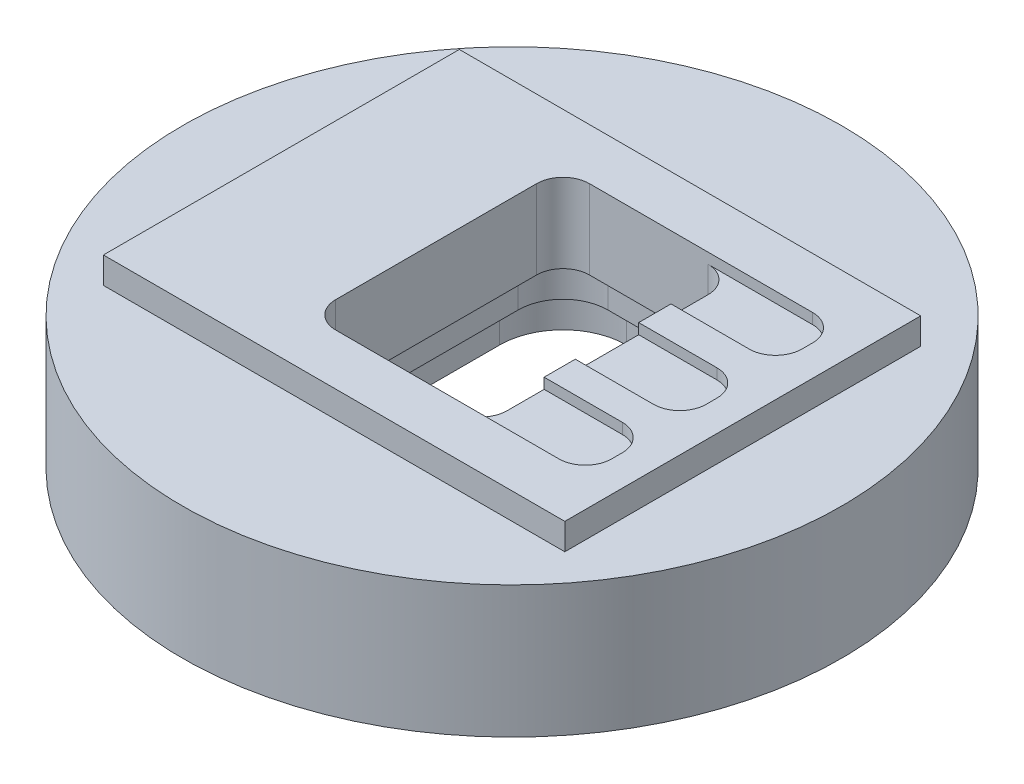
ISO-10303-21;
HEADER;
FILE_DESCRIPTION(('STEP AP214'),'2;1');
FILE_NAME('part.step','',(''),(''),'','','');
FILE_SCHEMA(('AUTOMOTIVE_DESIGN { 1 0 10303 214 1 1 1 1 }'));
ENDSEC;
DATA;
#1=APPLICATION_CONTEXT('core data for automotive mechanical design processes');
#2=APPLICATION_PROTOCOL_DEFINITION('international standard','automotive_design',2000,#1);
#3=PRODUCT_CONTEXT('',#1,'mechanical');
#4=PRODUCT('Part','Part','',(#3));
#5=PRODUCT_RELATED_PRODUCT_CATEGORY('part','',(#4));
#6=PRODUCT_DEFINITION_FORMATION('','',#4);
#7=PRODUCT_DEFINITION_CONTEXT('part definition',#1,'design');
#8=PRODUCT_DEFINITION('design','',#6,#7);
#9=PRODUCT_DEFINITION_SHAPE('','',#8);
#10=(LENGTH_UNIT() NAMED_UNIT(*) SI_UNIT(.MILLI.,.METRE.));
#11=(NAMED_UNIT(*) PLANE_ANGLE_UNIT() SI_UNIT($,.RADIAN.));
#12=(NAMED_UNIT(*) SI_UNIT($,.STERADIAN.) SOLID_ANGLE_UNIT());
#13=UNCERTAINTY_MEASURE_WITH_UNIT(LENGTH_MEASURE(1.E-05),#10,'distance_accuracy_value','');
#14=(GEOMETRIC_REPRESENTATION_CONTEXT(3) GLOBAL_UNCERTAINTY_ASSIGNED_CONTEXT((#13)) GLOBAL_UNIT_ASSIGNED_CONTEXT((#10,
#11,#12)) REPRESENTATION_CONTEXT('',''));
#15=CARTESIAN_POINT('',(0.,0.,0.));
#16=DIRECTION('',(0.,0.,1.));
#17=DIRECTION('',(1.,0.,0.));
#18=AXIS2_PLACEMENT_3D('',#15,#16,#17);
#19=CARTESIAN_POINT('',(0.665988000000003,0.762,0.967905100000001));
#20=DIRECTION('',(0.,-1.,0.));
#21=DIRECTION('',(0.,0.,-1.));
#22=AXIS2_PLACEMENT_3D('',#19,#20,#21);
#23=CYLINDRICAL_SURFACE('',#22,0.4318);
#24=CARTESIAN_POINT('',(0.665988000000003,0.381,0.967905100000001));
#25=DIRECTION('',(0.,-1.,0.));
#26=DIRECTION('',(0.,0.,-1.));
#27=AXIS2_PLACEMENT_3D('',#24,#25,#26);
#28=CIRCLE('',#27,0.4318);
#29=CARTESIAN_POINT('',(0.665988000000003,0.381,1.3997051));
#30=VERTEX_POINT('',#29);
#31=CARTESIAN_POINT('',(1.097788,0.381,0.967905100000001));
#32=VERTEX_POINT('',#31);
#33=EDGE_CURVE('E394',#30,#32,#28,.F.);
#34=ORIENTED_EDGE('',*,*,#33,.F.);
#35=DIRECTION('',(0.,-1.,0.));
#36=VECTOR('',#35,1.);
#37=CARTESIAN_POINT('',(0.665988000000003,0.762,1.3997051));
#38=LINE('',#37,#36);
#39=CARTESIAN_POINT('',(0.665988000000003,0.762,1.3997051));
#40=VERTEX_POINT('',#39);
#41=EDGE_CURVE('E420',#40,#30,#38,.T.);
#42=ORIENTED_EDGE('',*,*,#41,.F.);
#43=CARTESIAN_POINT('',(0.665988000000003,0.762,0.967905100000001));
#44=DIRECTION('',(0.,-1.,0.));
#45=DIRECTION('',(0.,0.,-1.));
#46=AXIS2_PLACEMENT_3D('',#43,#44,#45);
#47=CIRCLE('',#46,0.4318);
#48=CARTESIAN_POINT('',(1.097788,0.762,0.967905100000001));
#49=VERTEX_POINT('',#48);
#50=EDGE_CURVE('E396',#49,#40,#47,.T.);
#51=ORIENTED_EDGE('',*,*,#50,.F.);
#52=DIRECTION('',(0.,-1.,0.));
#53=VECTOR('',#52,1.);
#54=CARTESIAN_POINT('',(1.097788,0.762,0.967905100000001));
#55=LINE('',#54,#53);
#56=EDGE_CURVE('E421',#49,#32,#55,.T.);
#57=ORIENTED_EDGE('',*,*,#56,.T.);
#58=EDGE_LOOP('',(#34,#42,#51,#57));
#59=FACE_BOUND('',#58,.T.);
#60=ADVANCED_FACE('F33',(#59),#23,.F.);
#61=CARTESIAN_POINT('',(1.097788,0.762,-0.967905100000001));
#62=DIRECTION('',(1.,0.,0.));
#63=DIRECTION('',(0.,0.,-1.));
#64=AXIS2_PLACEMENT_3D('',#61,#62,#63);
#65=PLANE('',#64);
#66=DIRECTION('',(0.,0.,-1.));
#67=VECTOR('',#66,1.);
#68=CARTESIAN_POINT('',(1.097788,0.381,-0.967905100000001));
#69=LINE('',#68,#67);
#70=CARTESIAN_POINT('',(1.097788,0.381,-0.967905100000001));
#71=VERTEX_POINT('',#70);
#72=EDGE_CURVE('E392',#32,#71,#69,.T.);
#73=ORIENTED_EDGE('',*,*,#72,.F.);
#74=ORIENTED_EDGE('',*,*,#56,.F.);
#75=DIRECTION('',(0.,0.,1.));
#76=VECTOR('',#75,1.);
#77=CARTESIAN_POINT('',(1.097788,0.762,-0.967905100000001));
#78=LINE('',#77,#76);
#79=CARTESIAN_POINT('',(1.097788,0.762,-0.967905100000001));
#80=VERTEX_POINT('',#79);
#81=EDGE_CURVE('E417',#80,#49,#78,.T.);
#82=ORIENTED_EDGE('',*,*,#81,.F.);
#83=DIRECTION('',(0.,-1.,0.));
#84=VECTOR('',#83,1.);
#85=CARTESIAN_POINT('',(1.097788,0.762,-0.967905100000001));
#86=LINE('',#85,#84);
#87=EDGE_CURVE('E425',#80,#71,#86,.T.);
#88=ORIENTED_EDGE('',*,*,#87,.T.);
#89=EDGE_LOOP('',(#73,#74,#82,#88));
#90=FACE_BOUND('',#89,.T.);
#91=ADVANCED_FACE('F763',(#90),#65,.F.);
#92=CARTESIAN_POINT('',(0.665988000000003,0.762,-0.967905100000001));
#93=DIRECTION('',(0.,-1.,0.));
#94=DIRECTION('',(0.,0.,-1.));
#95=AXIS2_PLACEMENT_3D('',#92,#93,#94);
#96=CYLINDRICAL_SURFACE('',#95,0.4318);
#97=CARTESIAN_POINT('',(0.665988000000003,0.381,-0.967905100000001));
#98=DIRECTION('',(0.,-1.,0.));
#99=DIRECTION('',(0.,0.,-1.));
#100=AXIS2_PLACEMENT_3D('',#97,#98,#99);
#101=CIRCLE('',#100,0.4318);
#102=CARTESIAN_POINT('',(0.665988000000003,0.381,-1.3997051));
#103=VERTEX_POINT('',#102);
#104=EDGE_CURVE('E390',#71,#103,#101,.F.);
#105=ORIENTED_EDGE('',*,*,#104,.F.);
#106=ORIENTED_EDGE('',*,*,#87,.F.);
#107=CARTESIAN_POINT('',(0.665988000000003,0.762,-0.967905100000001));
#108=DIRECTION('',(0.,-1.,0.));
#109=DIRECTION('',(0.,0.,-1.));
#110=AXIS2_PLACEMENT_3D('',#107,#108,#109);
#111=CIRCLE('',#110,0.4318);
#112=CARTESIAN_POINT('',(0.665988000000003,0.762,-1.3997051));
#113=VERTEX_POINT('',#112);
#114=EDGE_CURVE('E414',#113,#80,#111,.T.);
#115=ORIENTED_EDGE('',*,*,#114,.F.);
#116=DIRECTION('',(0.,-1.,0.));
#117=VECTOR('',#116,1.);
#118=CARTESIAN_POINT('',(0.665988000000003,0.762,-1.3997051));
#119=LINE('',#118,#117);
#120=EDGE_CURVE('E428',#113,#103,#119,.T.);
#121=ORIENTED_EDGE('',*,*,#120,.T.);
#122=EDGE_LOOP('',(#105,#106,#115,#121));
#123=FACE_BOUND('',#122,.T.);
#124=ADVANCED_FACE('F769',(#123),#96,.F.);
#125=CARTESIAN_POINT('',(-0.477011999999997,0.762,-1.3997051));
#126=DIRECTION('',(0.,0.,-1.));
#127=DIRECTION('',(-1.,0.,0.));
#128=AXIS2_PLACEMENT_3D('',#125,#126,#127);
#129=PLANE('',#128);
#130=DIRECTION('',(-1.,0.,0.));
#131=VECTOR('',#130,1.);
#132=CARTESIAN_POINT('',(-0.477011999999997,0.381,-1.3997051));
#133=LINE('',#132,#131);
#134=CARTESIAN_POINT('',(-0.477011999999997,0.381,-1.3997051));
#135=VERTEX_POINT('',#134);
#136=EDGE_CURVE('E388',#103,#135,#133,.T.);
#137=ORIENTED_EDGE('',*,*,#136,.F.);
#138=ORIENTED_EDGE('',*,*,#120,.F.);
#139=DIRECTION('',(1.,0.,0.));
#140=VECTOR('',#139,1.);
#141=CARTESIAN_POINT('',(-0.477011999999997,0.762,-1.3997051));
#142=LINE('',#141,#140);
#143=CARTESIAN_POINT('',(-0.477011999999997,0.762,-1.3997051));
#144=VERTEX_POINT('',#143);
#145=EDGE_CURVE('E411',#144,#113,#142,.T.);
#146=ORIENTED_EDGE('',*,*,#145,.F.);
#147=DIRECTION('',(0.,-1.,0.));
#148=VECTOR('',#147,1.);
#149=CARTESIAN_POINT('',(-0.477011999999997,0.762,-1.3997051));
#150=LINE('',#149,#148);
#151=EDGE_CURVE('E431',#144,#135,#150,.T.);
#152=ORIENTED_EDGE('',*,*,#151,.T.);
#153=EDGE_LOOP('',(#137,#138,#146,#152));
#154=FACE_BOUND('',#153,.T.);
#155=ADVANCED_FACE('F932',(#154),#129,.F.);
#156=CARTESIAN_POINT('',(-0.477011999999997,0.762,-0.967905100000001));
#157=DIRECTION('',(0.,-1.,0.));
#158=DIRECTION('',(0.,0.,-1.));
#159=AXIS2_PLACEMENT_3D('',#156,#157,#158);
#160=CYLINDRICAL_SURFACE('',#159,0.4318);
#161=CARTESIAN_POINT('',(-0.477011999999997,0.381,-0.967905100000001));
#162=DIRECTION('',(0.,-1.,0.));
#163=DIRECTION('',(0.,0.,-1.));
#164=AXIS2_PLACEMENT_3D('',#161,#162,#163);
#165=CIRCLE('',#164,0.4318);
#166=CARTESIAN_POINT('',(-0.908811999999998,0.381,-0.967905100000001));
#167=VERTEX_POINT('',#166);
#168=EDGE_CURVE('E386',#135,#167,#165,.F.);
#169=ORIENTED_EDGE('',*,*,#168,.F.);
#170=ORIENTED_EDGE('',*,*,#151,.F.);
#171=CARTESIAN_POINT('',(-0.477011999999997,0.762,-0.967905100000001));
#172=DIRECTION('',(0.,-1.,0.));
#173=DIRECTION('',(0.,0.,-1.));
#174=AXIS2_PLACEMENT_3D('',#171,#172,#173);
#175=CIRCLE('',#174,0.4318);
#176=CARTESIAN_POINT('',(-0.908811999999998,0.762,-0.967905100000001));
#177=VERTEX_POINT('',#176);
#178=EDGE_CURVE('E408',#177,#144,#175,.T.);
#179=ORIENTED_EDGE('',*,*,#178,.F.);
#180=DIRECTION('',(0.,-1.,0.));
#181=VECTOR('',#180,1.);
#182=CARTESIAN_POINT('',(-0.908811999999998,0.762,-0.967905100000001));
#183=LINE('',#182,#181);
#184=EDGE_CURVE('E434',#177,#167,#183,.T.);
#185=ORIENTED_EDGE('',*,*,#184,.T.);
#186=EDGE_LOOP('',(#169,#170,#179,#185));
#187=FACE_BOUND('',#186,.T.);
#188=ADVANCED_FACE('F942',(#187),#160,.F.);
#189=CARTESIAN_POINT('',(-0.908811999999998,0.762,0.967905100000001));
#190=DIRECTION('',(-1.,0.,0.));
#191=DIRECTION('',(0.,0.,1.));
#192=AXIS2_PLACEMENT_3D('',#189,#190,#191);
#193=PLANE('',#192);
#194=DIRECTION('',(0.,0.,1.));
#195=VECTOR('',#194,1.);
#196=CARTESIAN_POINT('',(-0.908811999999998,0.381,0.967905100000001));
#197=LINE('',#196,#195);
#198=CARTESIAN_POINT('',(-0.908811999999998,0.381,0.967905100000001));
#199=VERTEX_POINT('',#198);
#200=EDGE_CURVE('E384',#167,#199,#197,.T.);
#201=ORIENTED_EDGE('',*,*,#200,.F.);
#202=ORIENTED_EDGE('',*,*,#184,.F.);
#203=DIRECTION('',(0.,0.,-1.));
#204=VECTOR('',#203,1.);
#205=CARTESIAN_POINT('',(-0.908811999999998,0.762,0.967905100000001));
#206=LINE('',#205,#204);
#207=CARTESIAN_POINT('',(-0.908811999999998,0.762,0.967905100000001));
#208=VERTEX_POINT('',#207);
#209=EDGE_CURVE('E405',#208,#177,#206,.T.);
#210=ORIENTED_EDGE('',*,*,#209,.F.);
#211=DIRECTION('',(0.,-1.,0.));
#212=VECTOR('',#211,1.);
#213=CARTESIAN_POINT('',(-0.908811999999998,0.762,0.967905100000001));
#214=LINE('',#213,#212);
#215=EDGE_CURVE('E437',#208,#199,#214,.T.);
#216=ORIENTED_EDGE('',*,*,#215,.T.);
#217=EDGE_LOOP('',(#201,#202,#210,#216));
#218=FACE_BOUND('',#217,.T.);
#219=ADVANCED_FACE('F952',(#218),#193,.F.);
#220=CARTESIAN_POINT('',(-0.477011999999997,0.762,0.967905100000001));
#221=DIRECTION('',(0.,-1.,0.));
#222=DIRECTION('',(0.,0.,-1.));
#223=AXIS2_PLACEMENT_3D('',#220,#221,#222);
#224=CYLINDRICAL_SURFACE('',#223,0.4318);
#225=CARTESIAN_POINT('',(-0.477011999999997,0.381,0.967905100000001));
#226=DIRECTION('',(0.,-1.,0.));
#227=DIRECTION('',(0.,0.,-1.));
#228=AXIS2_PLACEMENT_3D('',#225,#226,#227);
#229=CIRCLE('',#228,0.4318);
#230=CARTESIAN_POINT('',(-0.477011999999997,0.381,1.3997051));
#231=VERTEX_POINT('',#230);
#232=EDGE_CURVE('E55',#199,#231,#229,.F.);
#233=ORIENTED_EDGE('',*,*,#232,.F.);
#234=ORIENTED_EDGE('',*,*,#215,.F.);
#235=CARTESIAN_POINT('',(-0.477011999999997,0.762,0.967905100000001));
#236=DIRECTION('',(0.,-1.,0.));
#237=DIRECTION('',(0.,0.,-1.));
#238=AXIS2_PLACEMENT_3D('',#235,#236,#237);
#239=CIRCLE('',#238,0.4318);
#240=CARTESIAN_POINT('',(-0.477011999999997,0.762,1.3997051));
#241=VERTEX_POINT('',#240);
#242=EDGE_CURVE('E402',#241,#208,#239,.T.);
#243=ORIENTED_EDGE('',*,*,#242,.F.);
#244=DIRECTION('',(0.,-1.,0.));
#245=VECTOR('',#244,1.);
#246=CARTESIAN_POINT('',(-0.477011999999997,0.762,1.3997051));
#247=LINE('',#246,#245);
#248=EDGE_CURVE('E440',#241,#231,#247,.T.);
#249=ORIENTED_EDGE('',*,*,#248,.T.);
#250=EDGE_LOOP('',(#233,#234,#243,#249));
#251=FACE_BOUND('',#250,.T.);
#252=ADVANCED_FACE('F962',(#251),#224,.F.);
#253=CARTESIAN_POINT('',(0.665988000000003,0.762,1.3997051));
#254=DIRECTION('',(0.,0.,1.));
#255=DIRECTION('',(1.,0.,0.));
#256=AXIS2_PLACEMENT_3D('',#253,#254,#255);
#257=PLANE('',#256);
#258=DIRECTION('',(1.,0.,0.));
#259=VECTOR('',#258,1.);
#260=CARTESIAN_POINT('',(0.665988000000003,0.381,1.3997051));
#261=LINE('',#260,#259);
#262=EDGE_CURVE('E11',#231,#30,#261,.T.);
#263=ORIENTED_EDGE('',*,*,#262,.F.);
#264=ORIENTED_EDGE('',*,*,#248,.F.);
#265=DIRECTION('',(-1.,0.,0.));
#266=VECTOR('',#265,1.);
#267=CARTESIAN_POINT('',(0.665988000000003,0.762,1.3997051));
#268=LINE('',#267,#266);
#269=EDGE_CURVE('E399',#40,#241,#268,.T.);
#270=ORIENTED_EDGE('',*,*,#269,.F.);
#271=ORIENTED_EDGE('',*,*,#41,.T.);
#272=EDGE_LOOP('',(#263,#264,#270,#271));
#273=FACE_BOUND('',#272,.T.);
#274=ADVANCED_FACE('F775',(#273),#257,.F.);
#275=CARTESIAN_POINT('',(-0.477011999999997,1.4224,-0.967905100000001));
#276=DIRECTION('',(0.,1.,0.));
#277=DIRECTION('',(0.,0.,1.));
#278=AXIS2_PLACEMENT_3D('',#275,#276,#277);
#279=CYLINDRICAL_SURFACE('',#278,0.254);
#280=CARTESIAN_POINT('',(-0.477011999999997,0.762,-0.967905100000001));
#281=DIRECTION('',(0.,-1.,0.));
#282=DIRECTION('',(0.,0.,-1.));
#283=AXIS2_PLACEMENT_3D('',#280,#281,#282);
#284=CIRCLE('',#283,0.254);
#285=CARTESIAN_POINT('',(-0.477011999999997,0.762,-1.2219051));
#286=VERTEX_POINT('',#285);
#287=CARTESIAN_POINT('',(-0.731011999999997,0.762,-0.967905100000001));
#288=VERTEX_POINT('',#287);
#289=EDGE_CURVE('E452',#286,#288,#284,.F.);
#290=ORIENTED_EDGE('',*,*,#289,.F.);
#291=DIRECTION('',(0.,1.,0.));
#292=VECTOR('',#291,1.);
#293=CARTESIAN_POINT('',(-0.477011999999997,1.4224,-1.2219051));
#294=LINE('',#293,#292);
#295=CARTESIAN_POINT('',(-0.477011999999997,1.524,-1.2219051));
#296=VERTEX_POINT('',#295);
#297=EDGE_CURVE('E616',#286,#296,#294,.T.);
#298=ORIENTED_EDGE('',*,*,#297,.T.);
#299=CARTESIAN_POINT('',(-0.477011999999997,1.524,-0.967905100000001));
#300=DIRECTION('',(0.,1.,0.));
#301=DIRECTION('',(0.,0.,-1.));
#302=AXIS2_PLACEMENT_3D('',#299,#300,#301);
#303=CIRCLE('',#302,0.254);
#304=CARTESIAN_POINT('',(-0.731011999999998,1.524,-0.967905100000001));
#305=VERTEX_POINT('',#304);
#306=EDGE_CURVE('E522',#296,#305,#303,.T.);
#307=ORIENTED_EDGE('',*,*,#306,.T.);
#308=DIRECTION('',(0.,1.,0.));
#309=VECTOR('',#308,1.);
#310=CARTESIAN_POINT('',(-0.731011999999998,1.4224,-0.967905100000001));
#311=LINE('',#310,#309);
#312=EDGE_CURVE('E566',#288,#305,#311,.T.);
#313=ORIENTED_EDGE('',*,*,#312,.F.);
#314=EDGE_LOOP('',(#290,#298,#307,#313));
#315=FACE_BOUND('',#314,.T.);
#316=ADVANCED_FACE('F734',(#315),#279,.F.);
#317=CARTESIAN_POINT('',(-0.477011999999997,1.4224,-1.2219051));
#318=DIRECTION('',(0.,0.,-1.));
#319=DIRECTION('',(-1.,0.,0.));
#320=AXIS2_PLACEMENT_3D('',#317,#318,#319);
#321=PLANE('',#320);
#322=DIRECTION('',(-1.,0.,0.));
#323=VECTOR('',#322,1.);
#324=CARTESIAN_POINT('',(-0.477011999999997,0.762,-1.2219051));
#325=LINE('',#324,#323);
#326=CARTESIAN_POINT('',(0.665988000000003,0.762,-1.2219051));
#327=VERTEX_POINT('',#326);
#328=EDGE_CURVE('E450',#327,#286,#325,.T.);
#329=ORIENTED_EDGE('',*,*,#328,.F.);
#330=DIRECTION('',(0.,-1.,0.));
#331=VECTOR('',#330,1.);
#332=CARTESIAN_POINT('',(0.665988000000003,1.524,-1.2219051));
#333=LINE('',#332,#331);
#334=CARTESIAN_POINT('',(0.665988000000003,1.4224,-1.2219051));
#335=VERTEX_POINT('',#334);
#336=EDGE_CURVE('E508',#335,#327,#333,.T.);
#337=ORIENTED_EDGE('',*,*,#336,.F.);
#338=DIRECTION('',(-1.,0.,0.));
#339=VECTOR('',#338,1.);
#340=CARTESIAN_POINT('',(-0.477011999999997,1.4224,-1.2219051));
#341=LINE('',#340,#339);
#342=CARTESIAN_POINT('',(1.673098,1.4224,-1.2219051));
#343=VERTEX_POINT('',#342);
#344=EDGE_CURVE('E563',#343,#335,#341,.T.);
#345=ORIENTED_EDGE('',*,*,#344,.F.);
#346=DIRECTION('',(0.,1.,0.));
#347=VECTOR('',#346,1.);
#348=CARTESIAN_POINT('',(1.673098,1.4224,-1.2219051));
#349=LINE('',#348,#347);
#350=CARTESIAN_POINT('',(1.673098,1.524,-1.2219051));
#351=VERTEX_POINT('',#350);
#352=EDGE_CURVE('E619',#343,#351,#349,.T.);
#353=ORIENTED_EDGE('',*,*,#352,.T.);
#354=DIRECTION('',(-1.,0.,0.));
#355=VECTOR('',#354,1.);
#356=CARTESIAN_POINT('',(-0.477011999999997,1.524,-1.2219051));
#357=LINE('',#356,#355);
#358=EDGE_CURVE('E526',#351,#296,#357,.T.);
#359=ORIENTED_EDGE('',*,*,#358,.T.);
#360=ORIENTED_EDGE('',*,*,#297,.F.);
#361=EDGE_LOOP('',(#329,#337,#345,#353,#359,#360));
#362=FACE_BOUND('',#361,.T.);
#363=ADVANCED_FACE('F727',(#362),#321,.F.);
#364=CARTESIAN_POINT('',(-0.477011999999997,1.4224,1.2219051));
#365=DIRECTION('',(0.,0.,1.));
#366=DIRECTION('',(1.,0.,0.));
#367=AXIS2_PLACEMENT_3D('',#364,#365,#366);
#368=PLANE('',#367);
#369=DIRECTION('',(1.,0.,0.));
#370=VECTOR('',#369,1.);
#371=CARTESIAN_POINT('',(-0.477011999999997,0.762,1.2219051));
#372=LINE('',#371,#370);
#373=CARTESIAN_POINT('',(-0.477011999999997,0.762,1.2219051));
#374=VERTEX_POINT('',#373);
#375=CARTESIAN_POINT('',(0.665988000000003,0.762,1.2219051));
#376=VERTEX_POINT('',#375);
#377=EDGE_CURVE('E448',#374,#376,#372,.T.);
#378=ORIENTED_EDGE('',*,*,#377,.F.);
#379=DIRECTION('',(0.,1.,0.));
#380=VECTOR('',#379,1.);
#381=CARTESIAN_POINT('',(-0.477011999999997,1.4224,1.2219051));
#382=LINE('',#381,#380);
#383=CARTESIAN_POINT('',(-0.477011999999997,1.524,1.2219051));
#384=VERTEX_POINT('',#383);
#385=EDGE_CURVE('E646',#374,#384,#382,.T.);
#386=ORIENTED_EDGE('',*,*,#385,.T.);
#387=DIRECTION('',(1.,0.,0.));
#388=VECTOR('',#387,1.);
#389=CARTESIAN_POINT('',(-0.477011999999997,1.524,1.2219051));
#390=LINE('',#389,#388);
#391=CARTESIAN_POINT('',(1.673098,1.524,1.2219051));
#392=VERTEX_POINT('',#391);
#393=EDGE_CURVE('E575',#384,#392,#390,.T.);
#394=ORIENTED_EDGE('',*,*,#393,.T.);
#395=DIRECTION('',(0.,1.,0.));
#396=VECTOR('',#395,1.);
#397=CARTESIAN_POINT('',(1.673098,1.4224,1.2219051));
#398=LINE('',#397,#396);
#399=CARTESIAN_POINT('',(1.673098,1.4224,1.2219051));
#400=VERTEX_POINT('',#399);
#401=EDGE_CURVE('E643',#400,#392,#398,.T.);
#402=ORIENTED_EDGE('',*,*,#401,.F.);
#403=DIRECTION('',(1.,0.,0.));
#404=VECTOR('',#403,1.);
#405=CARTESIAN_POINT('',(-0.477011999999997,1.4224,1.2219051));
#406=LINE('',#405,#404);
#407=CARTESIAN_POINT('',(0.665988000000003,1.4224,1.2219051));
#408=VERTEX_POINT('',#407);
#409=EDGE_CURVE('E523',#408,#400,#406,.T.);
#410=ORIENTED_EDGE('',*,*,#409,.F.);
#411=DIRECTION('',(0.,-1.,0.));
#412=VECTOR('',#411,1.);
#413=CARTESIAN_POINT('',(0.665988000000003,1.524,1.2219051));
#414=LINE('',#413,#412);
#415=EDGE_CURVE('E498',#408,#376,#414,.T.);
#416=ORIENTED_EDGE('',*,*,#415,.T.);
#417=EDGE_LOOP('',(#378,#386,#394,#402,#410,#416));
#418=FACE_BOUND('',#417,.T.);
#419=ADVANCED_FACE('F748',(#418),#368,.F.);
#420=CARTESIAN_POINT('',(-0.477011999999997,1.4224,0.967905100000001));
#421=DIRECTION('',(0.,1.,0.));
#422=DIRECTION('',(0.,0.,1.));
#423=AXIS2_PLACEMENT_3D('',#420,#421,#422);
#424=CYLINDRICAL_SURFACE('',#423,0.254);
#425=CARTESIAN_POINT('',(-0.477011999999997,0.762,0.967905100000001));
#426=DIRECTION('',(0.,-1.,0.));
#427=DIRECTION('',(0.,0.,-1.));
#428=AXIS2_PLACEMENT_3D('',#425,#426,#427);
#429=CIRCLE('',#428,0.254);
#430=CARTESIAN_POINT('',(-0.731011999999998,0.762,0.967905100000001));
#431=VERTEX_POINT('',#430);
#432=EDGE_CURVE('E456',#431,#374,#429,.F.);
#433=ORIENTED_EDGE('',*,*,#432,.F.);
#434=DIRECTION('',(0.,1.,0.));
#435=VECTOR('',#434,1.);
#436=CARTESIAN_POINT('',(-0.731011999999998,1.4224,0.967905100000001));
#437=LINE('',#436,#435);
#438=CARTESIAN_POINT('',(-0.731011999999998,1.524,0.967905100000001));
#439=VERTEX_POINT('',#438);
#440=EDGE_CURVE('E648',#431,#439,#437,.T.);
#441=ORIENTED_EDGE('',*,*,#440,.T.);
#442=CARTESIAN_POINT('',(-0.477011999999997,1.524,0.967905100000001));
#443=DIRECTION('',(0.,1.,0.));
#444=DIRECTION('',(0.,0.,-1.));
#445=AXIS2_PLACEMENT_3D('',#442,#443,#444);
#446=CIRCLE('',#445,0.254);
#447=EDGE_CURVE('E572',#439,#384,#446,.T.);
#448=ORIENTED_EDGE('',*,*,#447,.T.);
#449=ORIENTED_EDGE('',*,*,#385,.F.);
#450=EDGE_LOOP('',(#433,#441,#448,#449));
#451=FACE_BOUND('',#450,.T.);
#452=ADVANCED_FACE('F745',(#451),#424,.F.);
#453=CARTESIAN_POINT('',(-0.731011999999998,1.4224,0.967905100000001));
#454=DIRECTION('',(-1.,0.,0.));
#455=DIRECTION('',(0.,0.,1.));
#456=AXIS2_PLACEMENT_3D('',#453,#454,#455);
#457=PLANE('',#456);
#458=DIRECTION('',(0.,0.,1.));
#459=VECTOR('',#458,1.);
#460=CARTESIAN_POINT('',(-0.731011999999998,0.762,0.967905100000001));
#461=LINE('',#460,#459);
#462=EDGE_CURVE('E454',#288,#431,#461,.T.);
#463=ORIENTED_EDGE('',*,*,#462,.F.);
#464=ORIENTED_EDGE('',*,*,#312,.T.);
#465=DIRECTION('',(0.,0.,1.));
#466=VECTOR('',#465,1.);
#467=CARTESIAN_POINT('',(-0.731011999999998,1.524,0.967905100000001));
#468=LINE('',#467,#466);
#469=EDGE_CURVE('E569',#305,#439,#468,.T.);
#470=ORIENTED_EDGE('',*,*,#469,.T.);
#471=ORIENTED_EDGE('',*,*,#440,.F.);
#472=EDGE_LOOP('',(#463,#464,#470,#471));
#473=FACE_BOUND('',#472,.T.);
#474=ADVANCED_FACE('F738',(#473),#457,.F.);
#475=CARTESIAN_POINT('',(0.665988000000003,1.524,0.967905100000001));
#476=DIRECTION('',(0.,-1.,0.));
#477=DIRECTION('',(0.,0.,-1.));
#478=AXIS2_PLACEMENT_3D('',#475,#476,#477);
#479=CYLINDRICAL_SURFACE('',#478,0.254);
#480=CARTESIAN_POINT('',(0.665988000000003,0.762,0.967905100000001));
#481=DIRECTION('',(0.,-1.,0.));
#482=DIRECTION('',(0.,0.,-1.));
#483=AXIS2_PLACEMENT_3D('',#480,#481,#482);
#484=CIRCLE('',#483,0.254);
#485=CARTESIAN_POINT('',(0.919988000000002,0.762,0.9679051));
#486=VERTEX_POINT('',#485);
#487=EDGE_CURVE('E446',#376,#486,#484,.F.);
#488=ORIENTED_EDGE('',*,*,#487,.F.);
#489=ORIENTED_EDGE('',*,*,#415,.F.);
#490=CARTESIAN_POINT('',(0.665988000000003,1.4224,0.967905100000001));
#491=DIRECTION('',(0.,-1.,0.));
#492=DIRECTION('',(0.,0.,-1.));
#493=AXIS2_PLACEMENT_3D('',#490,#491,#492);
#494=CIRCLE('',#493,0.254);
#495=CARTESIAN_POINT('',(0.919988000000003,1.4224,0.9679051));
#496=VERTEX_POINT('',#495);
#497=EDGE_CURVE('E661',#496,#408,#494,.T.);
#498=ORIENTED_EDGE('',*,*,#497,.F.);
#499=DIRECTION('',(0.,-1.,0.));
#500=VECTOR('',#499,1.);
#501=CARTESIAN_POINT('',(0.919988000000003,1.524,0.9679051));
#502=LINE('',#501,#500);
#503=EDGE_CURVE('E502',#496,#486,#502,.T.);
#504=ORIENTED_EDGE('',*,*,#503,.T.);
#505=EDGE_LOOP('',(#488,#489,#498,#504));
#506=FACE_BOUND('',#505,.T.);
#507=ADVANCED_FACE('F752',(#506),#479,.F.);
#508=CARTESIAN_POINT('',(0.919988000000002,1.524,0.9679051));
#509=DIRECTION('',(1.,0.,0.));
#510=DIRECTION('',(0.,0.,-1.));
#511=AXIS2_PLACEMENT_3D('',#508,#509,#510);
#512=PLANE('',#511);
#513=DIRECTION('',(0.,0.,-1.));
#514=VECTOR('',#513,1.);
#515=CARTESIAN_POINT('',(0.919988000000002,0.762,0.9679051));
#516=LINE('',#515,#514);
#517=CARTESIAN_POINT('',(0.919988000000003,0.762,-0.967905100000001));
#518=VERTEX_POINT('',#517);
#519=EDGE_CURVE('E424',#486,#518,#516,.T.);
#520=ORIENTED_EDGE('',*,*,#519,.F.);
#521=ORIENTED_EDGE('',*,*,#503,.F.);
#522=DIRECTION('',(0.,0.,1.));
#523=VECTOR('',#522,1.);
#524=CARTESIAN_POINT('',(0.919988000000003,1.4224,-0.967905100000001));
#525=LINE('',#524,#523);
#526=CARTESIAN_POINT('',(0.919988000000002,1.4224,0.611111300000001));
#527=VERTEX_POINT('',#526);
#528=EDGE_CURVE('E659',#527,#496,#525,.T.);
#529=ORIENTED_EDGE('',*,*,#528,.F.);
#530=DIRECTION('',(0.,-1.,0.));
#531=VECTOR('',#530,1.);
#532=CARTESIAN_POINT('',(0.919988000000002,1.4224,0.611111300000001));
#533=LINE('',#532,#531);
#534=CARTESIAN_POINT('',(0.919988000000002,1.524,0.611111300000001));
#535=VERTEX_POINT('',#534);
#536=EDGE_CURVE('E501',#535,#527,#533,.T.);
#537=ORIENTED_EDGE('',*,*,#536,.F.);
#538=DIRECTION('',(0.,0.,1.));
#539=VECTOR('',#538,1.);
#540=CARTESIAN_POINT('',(0.919988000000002,1.524,0.9679051));
#541=LINE('',#540,#539);
#542=CARTESIAN_POINT('',(0.919988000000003,1.524,0.3109087));
#543=VERTEX_POINT('',#542);
#544=EDGE_CURVE('E494',#543,#535,#541,.T.);
#545=ORIENTED_EDGE('',*,*,#544,.F.);
#546=DIRECTION('',(0.,1.,0.));
#547=VECTOR('',#546,1.);
#548=CARTESIAN_POINT('',(0.919988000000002,1.4224,0.310908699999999));
#549=LINE('',#548,#547);
#550=CARTESIAN_POINT('',(0.919988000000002,1.4224,0.310908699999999));
#551=VERTEX_POINT('',#550);
#552=EDGE_CURVE('E513',#551,#543,#549,.T.);
#553=ORIENTED_EDGE('',*,*,#552,.F.);
#554=CARTESIAN_POINT('',(0.919988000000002,1.4224,-0.299885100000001));
#555=VERTEX_POINT('',#554);
#556=EDGE_CURVE('E660',#555,#551,#525,.T.);
#557=ORIENTED_EDGE('',*,*,#556,.F.);
#558=DIRECTION('',(0.,-1.,0.));
#559=VECTOR('',#558,1.);
#560=CARTESIAN_POINT('',(0.919988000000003,1.4224,-0.299885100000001));
#561=LINE('',#560,#559);
#562=CARTESIAN_POINT('',(0.919988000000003,1.524,-0.2998851));
#563=VERTEX_POINT('',#562);
#564=EDGE_CURVE('E516',#563,#555,#561,.T.);
#565=ORIENTED_EDGE('',*,*,#564,.F.);
#566=CARTESIAN_POINT('',(0.919988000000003,1.524,-0.6111113));
#567=VERTEX_POINT('',#566);
#568=EDGE_CURVE('E497',#567,#563,#541,.T.);
#569=ORIENTED_EDGE('',*,*,#568,.F.);
#570=DIRECTION('',(0.,1.,0.));
#571=VECTOR('',#570,1.);
#572=CARTESIAN_POINT('',(0.919988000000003,1.4224,-0.611111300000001));
#573=LINE('',#572,#571);
#574=CARTESIAN_POINT('',(0.919988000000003,1.4224,-0.611111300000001));
#575=VERTEX_POINT('',#574);
#576=EDGE_CURVE('E519',#575,#567,#573,.T.);
#577=ORIENTED_EDGE('',*,*,#576,.F.);
#578=CARTESIAN_POINT('',(0.919988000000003,1.4224,-0.967905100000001));
#579=VERTEX_POINT('',#578);
#580=EDGE_CURVE('E656',#579,#575,#525,.T.);
#581=ORIENTED_EDGE('',*,*,#580,.F.);
#582=DIRECTION('',(0.,-1.,0.));
#583=VECTOR('',#582,1.);
#584=CARTESIAN_POINT('',(0.919988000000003,1.524,-0.967905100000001));
#585=LINE('',#584,#583);
#586=EDGE_CURVE('E505',#579,#518,#585,.T.);
#587=ORIENTED_EDGE('',*,*,#586,.T.);
#588=EDGE_LOOP('',(#520,#521,#529,#537,#545,#553,#557,#565,#569,#577,#581,#587));
#589=FACE_BOUND('',#588,.T.);
#590=ADVANCED_FACE('F677',(#589),#512,.F.);
#591=CARTESIAN_POINT('',(0.665988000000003,1.524,-0.967905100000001));
#592=DIRECTION('',(0.,-1.,0.));
#593=DIRECTION('',(0.,0.,-1.));
#594=AXIS2_PLACEMENT_3D('',#591,#592,#593);
#595=CYLINDRICAL_SURFACE('',#594,0.254);
#596=CARTESIAN_POINT('',(0.665988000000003,0.762,-0.967905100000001));
#597=DIRECTION('',(0.,-1.,0.));
#598=DIRECTION('',(0.,0.,-1.));
#599=AXIS2_PLACEMENT_3D('',#596,#597,#598);
#600=CIRCLE('',#599,0.254);
#601=EDGE_CURVE('E41',#518,#327,#600,.F.);
#602=ORIENTED_EDGE('',*,*,#601,.F.);
#603=ORIENTED_EDGE('',*,*,#586,.F.);
#604=CARTESIAN_POINT('',(0.665988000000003,1.4224,-0.967905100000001));
#605=DIRECTION('',(0.,-1.,0.));
#606=DIRECTION('',(0.,0.,-1.));
#607=AXIS2_PLACEMENT_3D('',#604,#605,#606);
#608=CIRCLE('',#607,0.254);
#609=EDGE_CURVE('E653',#335,#579,#608,.T.);
#610=ORIENTED_EDGE('',*,*,#609,.F.);
#611=ORIENTED_EDGE('',*,*,#336,.T.);
#612=EDGE_LOOP('',(#602,#603,#610,#611));
#613=FACE_BOUND('',#612,.T.);
#614=ADVANCED_FACE('F724',(#613),#595,.F.);
#615=CARTESIAN_POINT('',(0.,1.524,0.));
#616=DIRECTION('',(0.,-1.,0.));
#617=DIRECTION('',(0.,0.,-1.));
#618=AXIS2_PLACEMENT_3D('',#615,#616,#617);
#619=CYLINDRICAL_SURFACE('',#618,3.175);
#620=CARTESIAN_POINT('',(0.,0.,0.));
#621=DIRECTION('',(0.,1.,0.));
#622=DIRECTION('',(0.,0.,1.));
#623=AXIS2_PLACEMENT_3D('',#620,#621,#622);
#624=CIRCLE('',#623,3.175);
#625=CARTESIAN_POINT('',(0.,0.,-3.175));
#626=VERTEX_POINT('',#625);
#627=EDGE_CURVE('E618',#626,#626,#624,.T.);
#628=CARTESIAN_POINT('',(0.,1.27,0.));
#629=DIRECTION('',(0.,1.,0.));
#630=DIRECTION('',(0.,0.,1.));
#631=AXIS2_PLACEMENT_3D('',#628,#629,#630);
#632=CIRCLE('',#631,3.175);
#633=CARTESIAN_POINT('',(0.,1.27,-3.175));
#634=VERTEX_POINT('',#633);
#635=EDGE_CURVE('E485',#634,#634,#632,.T.);
#636=CARTESIAN_POINT('',(0.,0.,-3.175));
#637=CARTESIAN_POINT('',(0.,0.0132291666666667,-3.175));
#638=CARTESIAN_POINT('',(0.,0.0264583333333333,-3.175));
#639=CARTESIAN_POINT('',(0.,0.0529166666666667,-3.175));
#640=CARTESIAN_POINT('',(0.,0.0661458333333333,-3.175));
#641=CARTESIAN_POINT('',(0.,0.0926041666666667,-3.175));
#642=CARTESIAN_POINT('',(0.,0.105833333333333,-3.175));
#643=CARTESIAN_POINT('',(0.,0.132291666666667,-3.175));
#644=CARTESIAN_POINT('',(0.,0.145520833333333,-3.175));
#645=CARTESIAN_POINT('',(0.,0.171979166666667,-3.175));
#646=CARTESIAN_POINT('',(0.,0.185208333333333,-3.175));
#647=CARTESIAN_POINT('',(0.,0.211666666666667,-3.175));
#648=CARTESIAN_POINT('',(0.,0.224895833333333,-3.175));
#649=CARTESIAN_POINT('',(0.,0.251354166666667,-3.175));
#650=CARTESIAN_POINT('',(0.,0.264583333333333,-3.175));
#651=CARTESIAN_POINT('',(0.,0.291041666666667,-3.175));
#652=CARTESIAN_POINT('',(0.,0.304270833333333,-3.175));
#653=CARTESIAN_POINT('',(0.,0.330729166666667,-3.175));
#654=CARTESIAN_POINT('',(0.,0.343958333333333,-3.175));
#655=CARTESIAN_POINT('',(0.,0.370416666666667,-3.175));
#656=CARTESIAN_POINT('',(0.,0.383645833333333,-3.175));
#657=CARTESIAN_POINT('',(0.,0.410104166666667,-3.175));
#658=CARTESIAN_POINT('',(0.,0.423333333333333,-3.175));
#659=CARTESIAN_POINT('',(0.,0.449791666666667,-3.175));
#660=CARTESIAN_POINT('',(0.,0.463020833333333,-3.175));
#661=CARTESIAN_POINT('',(0.,0.489479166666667,-3.175));
#662=CARTESIAN_POINT('',(0.,0.502708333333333,-3.175));
#663=CARTESIAN_POINT('',(0.,0.529166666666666,-3.175));
#664=CARTESIAN_POINT('',(0.,0.542395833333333,-3.175));
#665=CARTESIAN_POINT('',(0.,0.568854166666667,-3.175));
#666=CARTESIAN_POINT('',(0.,0.582083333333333,-3.175));
#667=CARTESIAN_POINT('',(0.,0.608541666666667,-3.175));
#668=CARTESIAN_POINT('',(0.,0.621770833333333,-3.175));
#669=CARTESIAN_POINT('',(0.,0.648229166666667,-3.175));
#670=CARTESIAN_POINT('',(0.,0.661458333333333,-3.175));
#671=CARTESIAN_POINT('',(0.,0.687916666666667,-3.175));
#672=CARTESIAN_POINT('',(0.,0.701145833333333,-3.175));
#673=CARTESIAN_POINT('',(0.,0.727604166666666,-3.175));
#674=CARTESIAN_POINT('',(0.,0.740833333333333,-3.175));
#675=CARTESIAN_POINT('',(0.,0.767291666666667,-3.175));
#676=CARTESIAN_POINT('',(0.,0.780520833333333,-3.175));
#677=CARTESIAN_POINT('',(0.,0.806979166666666,-3.175));
#678=CARTESIAN_POINT('',(0.,0.820208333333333,-3.175));
#679=CARTESIAN_POINT('',(0.,0.846666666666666,-3.175));
#680=CARTESIAN_POINT('',(0.,0.859895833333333,-3.175));
#681=CARTESIAN_POINT('',(0.,0.886354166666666,-3.175));
#682=CARTESIAN_POINT('',(0.,0.899583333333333,-3.175));
#683=CARTESIAN_POINT('',(0.,0.926041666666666,-3.175));
#684=CARTESIAN_POINT('',(0.,0.939270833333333,-3.175));
#685=CARTESIAN_POINT('',(0.,0.965729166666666,-3.175));
#686=CARTESIAN_POINT('',(0.,0.978958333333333,-3.175));
#687=CARTESIAN_POINT('',(0.,1.00541666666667,-3.175));
#688=CARTESIAN_POINT('',(0.,1.01864583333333,-3.175));
#689=CARTESIAN_POINT('',(0.,1.04510416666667,-3.175));
#690=CARTESIAN_POINT('',(0.,1.05833333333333,-3.175));
#691=CARTESIAN_POINT('',(0.,1.08479166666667,-3.175));
#692=CARTESIAN_POINT('',(0.,1.09802083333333,-3.175));
#693=CARTESIAN_POINT('',(0.,1.12447916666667,-3.175));
#694=CARTESIAN_POINT('',(0.,1.13770833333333,-3.175));
#695=CARTESIAN_POINT('',(0.,1.16416666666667,-3.175));
#696=CARTESIAN_POINT('',(0.,1.17739583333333,-3.175));
#697=CARTESIAN_POINT('',(0.,1.20385416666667,-3.175));
#698=CARTESIAN_POINT('',(0.,1.21708333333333,-3.175));
#699=CARTESIAN_POINT('',(0.,1.24354166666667,-3.175));
#700=CARTESIAN_POINT('',(0.,1.25677083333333,-3.175));
#701=CARTESIAN_POINT('',(0.,1.27,-3.175));
#702=B_SPLINE_CURVE_WITH_KNOTS('',3,(#636,#637,#638,#639,#640,#641,#642,#643,#644,#645,#646,
#647,#648,#649,#650,#651,#652,#653,#654,#655,#656,#657,#658,#659,#660,#661,#662,#663,#664,#665,
#666,#667,#668,#669,#670,#671,#672,#673,#674,#675,#676,#677,#678,#679,#680,#681,#682,#683,#684,
#685,#686,#687,#688,#689,#690,#691,#692,#693,#694,#695,#696,#697,#698,#699,#700,#701),
.UNSPECIFIED.,.F.,.F.,(4,2,2,2,2,2,2,2,2,2,2,2,2,2,2,2,2,2,2,2,2,2,2,2,2,2,2,2,2,2,2,2,4),(0.,
0.0396875,0.079375,0.1190625,0.15875,0.1984375,0.238125,0.2778125,0.3175,0.3571875,0.396875,
0.4365625,0.47625,0.5159375,0.555625,0.5953125,0.635,0.6746875,0.714375,0.7540625,0.79375,
0.8334375,0.873125,0.9128125,0.9525,0.9921875,1.031875,1.0715625,1.11125,1.1509375,1.190625,
1.2303125,1.27),.UNSPECIFIED.);
#703=EDGE_CURVE('BSEAM35',#626,#634,#702,.T.);
#704=ORIENTED_EDGE('',*,*,#627,.T.);
#705=ORIENTED_EDGE('',*,*,#635,.F.);
#706=ORIENTED_EDGE('',*,*,#703,.T.);
#707=ORIENTED_EDGE('',*,*,#703,.F.);
#708=EDGE_LOOP('',(#704,#706,#705,#707));
#709=FACE_BOUND('',#708,.T.);
#710=ADVANCED_FACE('F35',(#709),#619,.T.);
#711=CARTESIAN_POINT('',(0.,1.524,0.));
#712=DIRECTION('',(0.,1.,0.));
#713=DIRECTION('',(0.,0.,1.));
#714=AXIS2_PLACEMENT_3D('',#711,#712,#713);
#715=PLANE('',#714);
#716=ORIENTED_EDGE('',*,*,#544,.T.);
#717=DIRECTION('',(-1.,0.,0.));
#718=VECTOR('',#717,1.);
#719=CARTESIAN_POINT('',(1.673098,1.524,0.611111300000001));
#720=LINE('',#719,#718);
#721=CARTESIAN_POINT('',(1.673098,1.524,0.611111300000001));
#722=VERTEX_POINT('',#721);
#723=EDGE_CURVE('E586',#722,#535,#720,.T.);
#724=ORIENTED_EDGE('',*,*,#723,.F.);
#725=CARTESIAN_POINT('',(1.673098,1.524,0.865111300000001));
#726=DIRECTION('',(0.,1.,0.));
#727=DIRECTION('',(0.,0.,1.));
#728=AXIS2_PLACEMENT_3D('',#725,#726,#727);
#729=CIRCLE('',#728,0.254);
#730=CARTESIAN_POINT('',(1.927098,1.524,0.865111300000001));
#731=VERTEX_POINT('',#730);
#732=EDGE_CURVE('E583',#731,#722,#729,.T.);
#733=ORIENTED_EDGE('',*,*,#732,.F.);
#734=DIRECTION('',(0.,0.,-1.));
#735=VECTOR('',#734,1.);
#736=CARTESIAN_POINT('',(1.927098,1.524,0.967905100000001));
#737=LINE('',#736,#735);
#738=CARTESIAN_POINT('',(1.927098,1.524,0.967905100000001));
#739=VERTEX_POINT('',#738);
#740=EDGE_CURVE('E580',#739,#731,#737,.T.);
#741=ORIENTED_EDGE('',*,*,#740,.F.);
#742=CARTESIAN_POINT('',(1.673098,1.524,0.967905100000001));
#743=DIRECTION('',(0.,1.,0.));
#744=DIRECTION('',(0.,0.,1.));
#745=AXIS2_PLACEMENT_3D('',#742,#743,#744);
#746=CIRCLE('',#745,0.254);
#747=EDGE_CURVE('E577',#392,#739,#746,.T.);
#748=ORIENTED_EDGE('',*,*,#747,.F.);
#749=ORIENTED_EDGE('',*,*,#393,.F.);
#750=ORIENTED_EDGE('',*,*,#447,.F.);
#751=ORIENTED_EDGE('',*,*,#469,.F.);
#752=ORIENTED_EDGE('',*,*,#306,.F.);
#753=ORIENTED_EDGE('',*,*,#358,.F.);
#754=CARTESIAN_POINT('',(1.673098,1.524,-0.967905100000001));
#755=DIRECTION('',(0.,1.,0.));
#756=DIRECTION('',(0.,0.,-1.));
#757=AXIS2_PLACEMENT_3D('',#754,#755,#756);
#758=CIRCLE('',#757,0.254);
#759=CARTESIAN_POINT('',(1.927098,1.524,-0.967905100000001));
#760=VERTEX_POINT('',#759);
#761=EDGE_CURVE('E611',#760,#351,#758,.T.);
#762=ORIENTED_EDGE('',*,*,#761,.F.);
#763=DIRECTION('',(0.,0.,-1.));
#764=VECTOR('',#763,1.);
#765=CARTESIAN_POINT('',(1.927098,1.524,-0.865111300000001));
#766=LINE('',#765,#764);
#767=CARTESIAN_POINT('',(1.927098,1.524,-0.865111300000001));
#768=VERTEX_POINT('',#767);
#769=EDGE_CURVE('E608',#768,#760,#766,.T.);
#770=ORIENTED_EDGE('',*,*,#769,.F.);
#771=CARTESIAN_POINT('',(1.673098,1.524,-0.865111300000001));
#772=DIRECTION('',(0.,1.,0.));
#773=DIRECTION('',(0.,0.,1.));
#774=AXIS2_PLACEMENT_3D('',#771,#772,#773);
#775=CIRCLE('',#774,0.254);
#776=CARTESIAN_POINT('',(1.673098,1.524,-0.611111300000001));
#777=VERTEX_POINT('',#776);
#778=EDGE_CURVE('E605',#777,#768,#775,.T.);
#779=ORIENTED_EDGE('',*,*,#778,.F.);
#780=DIRECTION('',(1.,0.,0.));
#781=VECTOR('',#780,1.);
#782=CARTESIAN_POINT('',(0.491985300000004,1.524,-0.611111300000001));
#783=LINE('',#782,#781);
#784=EDGE_CURVE('E603',#567,#777,#783,.T.);
#785=ORIENTED_EDGE('',*,*,#784,.F.);
#786=ORIENTED_EDGE('',*,*,#568,.T.);
#787=DIRECTION('',(-1.,0.,0.));
#788=VECTOR('',#787,1.);
#789=CARTESIAN_POINT('',(1.673098,1.524,-0.299885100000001));
#790=LINE('',#789,#788);
#791=CARTESIAN_POINT('',(1.673098,1.524,-0.299885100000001));
#792=VERTEX_POINT('',#791);
#793=EDGE_CURVE('E600',#792,#563,#790,.T.);
#794=ORIENTED_EDGE('',*,*,#793,.F.);
#795=CARTESIAN_POINT('',(1.673098,1.524,-0.0458851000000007));
#796=DIRECTION('',(0.,1.,0.));
#797=DIRECTION('',(0.,0.,1.));
#798=AXIS2_PLACEMENT_3D('',#795,#796,#797);
#799=CIRCLE('',#798,0.254);
#800=CARTESIAN_POINT('',(1.927098,1.524,-0.0458851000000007));
#801=VERTEX_POINT('',#800);
#802=EDGE_CURVE('E597',#801,#792,#799,.T.);
#803=ORIENTED_EDGE('',*,*,#802,.F.);
#804=DIRECTION('',(0.,0.,-1.));
#805=VECTOR('',#804,1.);
#806=CARTESIAN_POINT('',(1.927098,1.524,0.0569086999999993));
#807=LINE('',#806,#805);
#808=CARTESIAN_POINT('',(1.927098,1.524,0.0569086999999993));
#809=VERTEX_POINT('',#808);
#810=EDGE_CURVE('E594',#809,#801,#807,.T.);
#811=ORIENTED_EDGE('',*,*,#810,.F.);
#812=CARTESIAN_POINT('',(1.673098,1.524,0.0569086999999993));
#813=DIRECTION('',(0.,1.,0.));
#814=DIRECTION('',(0.,0.,1.));
#815=AXIS2_PLACEMENT_3D('',#812,#813,#814);
#816=CIRCLE('',#815,0.254);
#817=CARTESIAN_POINT('',(1.673098,1.524,0.310908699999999));
#818=VERTEX_POINT('',#817);
#819=EDGE_CURVE('E591',#818,#809,#816,.T.);
#820=ORIENTED_EDGE('',*,*,#819,.F.);
#821=DIRECTION('',(1.,0.,0.));
#822=VECTOR('',#821,1.);
#823=CARTESIAN_POINT('',(0.491985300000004,1.524,0.310908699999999));
#824=LINE('',#823,#822);
#825=EDGE_CURVE('E589',#543,#818,#824,.T.);
#826=ORIENTED_EDGE('',*,*,#825,.F.);
#827=EDGE_LOOP('',(#716,#724,#733,#741,#748,#749,#750,#751,#752,#753,#762,#770,#779,#785,#786,
#794,#803,#811,#820,#826));
#828=FACE_BOUND('',#827,.T.);
#829=DIRECTION('',(-1.,0.,0.));
#830=VECTOR('',#829,1.);
#831=CARTESIAN_POINT('',(-2.2225,1.524,-1.7145));
#832=LINE('',#831,#830);
#833=CARTESIAN_POINT('',(2.2225,1.524,-1.7145));
#834=VERTEX_POINT('',#833);
#835=CARTESIAN_POINT('',(-2.2225,1.524,-1.7145));
#836=VERTEX_POINT('',#835);
#837=EDGE_CURVE('E463',#834,#836,#832,.T.);
#838=ORIENTED_EDGE('',*,*,#837,.T.);
#839=DIRECTION('',(0.,0.,1.));
#840=VECTOR('',#839,1.);
#841=CARTESIAN_POINT('',(-2.2225,1.524,-1.7145));
#842=LINE('',#841,#840);
#843=CARTESIAN_POINT('',(-2.2225,1.524,1.7145));
#844=VERTEX_POINT('',#843);
#845=EDGE_CURVE('E458',#836,#844,#842,.T.);
#846=ORIENTED_EDGE('',*,*,#845,.T.);
#847=DIRECTION('',(1.,0.,0.));
#848=VECTOR('',#847,1.);
#849=CARTESIAN_POINT('',(-2.2225,1.524,1.7145));
#850=LINE('',#849,#848);
#851=CARTESIAN_POINT('',(2.2225,1.524,1.7145));
#852=VERTEX_POINT('',#851);
#853=EDGE_CURVE('E475',#844,#852,#850,.T.);
#854=ORIENTED_EDGE('',*,*,#853,.T.);
#855=DIRECTION('',(0.,0.,-1.));
#856=VECTOR('',#855,1.);
#857=CARTESIAN_POINT('',(2.2225,1.524,-1.7145));
#858=LINE('',#857,#856);
#859=EDGE_CURVE('E478',#852,#834,#858,.T.);
#860=ORIENTED_EDGE('',*,*,#859,.T.);
#861=EDGE_LOOP('',(#838,#846,#854,#860));
#862=FACE_BOUND('',#861,.T.);
#863=ADVANCED_FACE('F683',(#828,#862),#715,.T.);
#864=CARTESIAN_POINT('',(-0.477011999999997,1.4224,-0.967905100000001));
#865=DIRECTION('',(0.,-1.,0.));
#866=DIRECTION('',(0.,0.,-1.));
#867=AXIS2_PLACEMENT_3D('',#864,#865,#866);
#868=PLANE('',#867);
#869=DIRECTION('',(-1.,0.,0.));
#870=VECTOR('',#869,1.);
#871=CARTESIAN_POINT('',(1.673098,1.4224,-0.299885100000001));
#872=LINE('',#871,#870);
#873=CARTESIAN_POINT('',(1.673098,1.4224,-0.299885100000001));
#874=VERTEX_POINT('',#873);
#875=EDGE_CURVE('E549',#874,#555,#872,.T.);
#876=ORIENTED_EDGE('',*,*,#875,.T.);
#877=ORIENTED_EDGE('',*,*,#556,.T.);
#878=DIRECTION('',(1.,0.,0.));
#879=VECTOR('',#878,1.);
#880=CARTESIAN_POINT('',(0.491985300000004,1.4224,0.310908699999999));
#881=LINE('',#880,#879);
#882=CARTESIAN_POINT('',(1.673098,1.4224,0.310908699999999));
#883=VERTEX_POINT('',#882);
#884=EDGE_CURVE('E538',#551,#883,#881,.T.);
#885=ORIENTED_EDGE('',*,*,#884,.T.);
#886=CARTESIAN_POINT('',(1.673098,1.4224,0.0569086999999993));
#887=DIRECTION('',(0.,1.,0.));
#888=DIRECTION('',(0.,0.,1.));
#889=AXIS2_PLACEMENT_3D('',#886,#887,#888);
#890=CIRCLE('',#889,0.254);
#891=CARTESIAN_POINT('',(1.927098,1.4224,0.0569086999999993));
#892=VERTEX_POINT('',#891);
#893=EDGE_CURVE('E540',#883,#892,#890,.T.);
#894=ORIENTED_EDGE('',*,*,#893,.T.);
#895=DIRECTION('',(0.,0.,-1.));
#896=VECTOR('',#895,1.);
#897=CARTESIAN_POINT('',(1.927098,1.4224,0.0569086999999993));
#898=LINE('',#897,#896);
#899=CARTESIAN_POINT('',(1.927098,1.4224,-0.0458851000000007));
#900=VERTEX_POINT('',#899);
#901=EDGE_CURVE('E543',#892,#900,#898,.T.);
#902=ORIENTED_EDGE('',*,*,#901,.T.);
#903=CARTESIAN_POINT('',(1.673098,1.4224,-0.0458851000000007));
#904=DIRECTION('',(0.,1.,0.));
#905=DIRECTION('',(0.,0.,1.));
#906=AXIS2_PLACEMENT_3D('',#903,#904,#905);
#907=CIRCLE('',#906,0.254);
#908=EDGE_CURVE('E546',#900,#874,#907,.T.);
#909=ORIENTED_EDGE('',*,*,#908,.T.);
#910=EDGE_LOOP('',(#876,#877,#885,#894,#902,#909));
#911=FACE_BOUND('',#910,.T.);
#912=ADVANCED_FACE('F692',(#911),#868,.F.);
#913=ORIENTED_EDGE('',*,*,#528,.T.);
#914=ORIENTED_EDGE('',*,*,#497,.T.);
#915=ORIENTED_EDGE('',*,*,#409,.T.);
#916=CARTESIAN_POINT('',(1.673098,1.4224,0.967905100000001));
#917=DIRECTION('',(0.,1.,0.));
#918=DIRECTION('',(0.,0.,1.));
#919=AXIS2_PLACEMENT_3D('',#916,#917,#918);
#920=CIRCLE('',#919,0.254);
#921=CARTESIAN_POINT('',(1.927098,1.4224,0.967905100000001));
#922=VERTEX_POINT('',#921);
#923=EDGE_CURVE('E525',#400,#922,#920,.T.);
#924=ORIENTED_EDGE('',*,*,#923,.T.);
#925=DIRECTION('',(0.,0.,-1.));
#926=VECTOR('',#925,1.);
#927=CARTESIAN_POINT('',(1.927098,1.4224,0.967905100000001));
#928=LINE('',#927,#926);
#929=CARTESIAN_POINT('',(1.927098,1.4224,0.865111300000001));
#930=VERTEX_POINT('',#929);
#931=EDGE_CURVE('E529',#922,#930,#928,.T.);
#932=ORIENTED_EDGE('',*,*,#931,.T.);
#933=CARTESIAN_POINT('',(1.673098,1.4224,0.865111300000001));
#934=DIRECTION('',(0.,1.,0.));
#935=DIRECTION('',(0.,0.,1.));
#936=AXIS2_PLACEMENT_3D('',#933,#934,#935);
#937=CIRCLE('',#936,0.254);
#938=CARTESIAN_POINT('',(1.673098,1.4224,0.611111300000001));
#939=VERTEX_POINT('',#938);
#940=EDGE_CURVE('E532',#930,#939,#937,.T.);
#941=ORIENTED_EDGE('',*,*,#940,.T.);
#942=DIRECTION('',(-1.,0.,0.));
#943=VECTOR('',#942,1.);
#944=CARTESIAN_POINT('',(1.673098,1.4224,0.611111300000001));
#945=LINE('',#944,#943);
#946=EDGE_CURVE('E535',#939,#527,#945,.T.);
#947=ORIENTED_EDGE('',*,*,#946,.T.);
#948=EDGE_LOOP('',(#913,#914,#915,#924,#932,#941,#947));
#949=FACE_BOUND('',#948,.T.);
#950=ADVANCED_FACE('F671',(#949),#868,.F.);
#951=CARTESIAN_POINT('',(0.,0.,0.));
#952=DIRECTION('',(0.,1.,0.));
#953=DIRECTION('',(0.,0.,1.));
#954=AXIS2_PLACEMENT_3D('',#951,#952,#953);
#955=PLANE('',#954);
#956=DIRECTION('',(1.,0.,0.));
#957=VECTOR('',#956,1.);
#958=CARTESIAN_POINT('',(-0.477011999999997,0.,-1.5775051));
#959=LINE('',#958,#957);
#960=CARTESIAN_POINT('',(-0.477011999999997,0.,-1.5775051));
#961=VERTEX_POINT('',#960);
#962=CARTESIAN_POINT('',(0.665988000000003,0.,-1.5775051));
#963=VERTEX_POINT('',#962);
#964=EDGE_CURVE('E354',#961,#963,#959,.T.);
#965=ORIENTED_EDGE('',*,*,#964,.F.);
#966=CARTESIAN_POINT('',(-0.477011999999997,0.,-0.967905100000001));
#967=DIRECTION('',(0.,-1.,0.));
#968=DIRECTION('',(0.,0.,-1.));
#969=AXIS2_PLACEMENT_3D('',#966,#967,#968);
#970=CIRCLE('',#969,0.6096);
#971=CARTESIAN_POINT('',(-1.086612,0.,-0.967905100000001));
#972=VERTEX_POINT('',#971);
#973=EDGE_CURVE('E48',#972,#961,#970,.T.);
#974=ORIENTED_EDGE('',*,*,#973,.F.);
#975=DIRECTION('',(0.,0.,-1.));
#976=VECTOR('',#975,1.);
#977=CARTESIAN_POINT('',(-1.086612,0.,0.967905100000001));
#978=LINE('',#977,#976);
#979=CARTESIAN_POINT('',(-1.086612,0.,0.967905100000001));
#980=VERTEX_POINT('',#979);
#981=EDGE_CURVE('E334',#980,#972,#978,.T.);
#982=ORIENTED_EDGE('',*,*,#981,.F.);
#983=CARTESIAN_POINT('',(-0.477011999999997,0.,0.967905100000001));
#984=DIRECTION('',(0.,-1.,0.));
#985=DIRECTION('',(0.,0.,-1.));
#986=AXIS2_PLACEMENT_3D('',#983,#984,#985);
#987=CIRCLE('',#986,0.6096);
#988=CARTESIAN_POINT('',(-0.477011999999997,0.,1.5775051));
#989=VERTEX_POINT('',#988);
#990=EDGE_CURVE('E337',#989,#980,#987,.T.);
#991=ORIENTED_EDGE('',*,*,#990,.F.);
#992=DIRECTION('',(-1.,0.,0.));
#993=VECTOR('',#992,1.);
#994=CARTESIAN_POINT('',(0.665988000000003,0.,1.5775051));
#995=LINE('',#994,#993);
#996=CARTESIAN_POINT('',(0.665988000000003,0.,1.5775051));
#997=VERTEX_POINT('',#996);
#998=EDGE_CURVE('E365',#997,#989,#995,.T.);
#999=ORIENTED_EDGE('',*,*,#998,.F.);
#1000=CARTESIAN_POINT('',(0.665988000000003,0.,0.967905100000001));
#1001=DIRECTION('',(0.,-1.,0.));
#1002=DIRECTION('',(0.,0.,-1.));
#1003=AXIS2_PLACEMENT_3D('',#1000,#1001,#1002);
#1004=CIRCLE('',#1003,0.6096);
#1005=CARTESIAN_POINT('',(1.275588,0.,0.967905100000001));
#1006=VERTEX_POINT('',#1005);
#1007=EDGE_CURVE('E362',#1006,#997,#1004,.T.);
#1008=ORIENTED_EDGE('',*,*,#1007,.F.);
#1009=DIRECTION('',(0.,0.,1.));
#1010=VECTOR('',#1009,1.);
#1011=CARTESIAN_POINT('',(1.275588,0.,-0.967905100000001));
#1012=LINE('',#1011,#1010);
#1013=CARTESIAN_POINT('',(1.275588,0.,-0.967905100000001));
#1014=VERTEX_POINT('',#1013);
#1015=EDGE_CURVE('E359',#1014,#1006,#1012,.T.);
#1016=ORIENTED_EDGE('',*,*,#1015,.F.);
#1017=CARTESIAN_POINT('',(0.665988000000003,0.,-0.967905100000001));
#1018=DIRECTION('',(0.,-1.,0.));
#1019=DIRECTION('',(0.,0.,-1.));
#1020=AXIS2_PLACEMENT_3D('',#1017,#1018,#1019);
#1021=CIRCLE('',#1020,0.6096);
#1022=EDGE_CURVE('E356',#963,#1014,#1021,.T.);
#1023=ORIENTED_EDGE('',*,*,#1022,.F.);
#1024=EDGE_LOOP('',(#965,#974,#982,#991,#999,#1008,#1016,#1023));
#1025=FACE_BOUND('',#1024,.T.);
#1026=ORIENTED_EDGE('',*,*,#627,.F.);
#1027=EDGE_LOOP('',(#1026));
#1028=FACE_BOUND('',#1027,.T.);
#1029=ADVANCED_FACE('F815',(#1025,#1028),#955,.F.);
#1030=CARTESIAN_POINT('',(1.673098,1.4224,-0.967905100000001));
#1031=DIRECTION('',(0.,1.,0.));
#1032=DIRECTION('',(0.,0.,1.));
#1033=AXIS2_PLACEMENT_3D('',#1030,#1031,#1032);
#1034=CYLINDRICAL_SURFACE('',#1033,0.254);
#1035=ORIENTED_EDGE('',*,*,#761,.T.);
#1036=ORIENTED_EDGE('',*,*,#352,.F.);
#1037=CARTESIAN_POINT('',(1.673098,1.4224,-0.967905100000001));
#1038=DIRECTION('',(0.,1.,0.));
#1039=DIRECTION('',(0.,0.,-1.));
#1040=AXIS2_PLACEMENT_3D('',#1037,#1038,#1039);
#1041=CIRCLE('',#1040,0.254);
#1042=CARTESIAN_POINT('',(1.927098,1.4224,-0.967905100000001));
#1043=VERTEX_POINT('',#1042);
#1044=EDGE_CURVE('E560',#1043,#343,#1041,.T.);
#1045=ORIENTED_EDGE('',*,*,#1044,.F.);
#1046=DIRECTION('',(0.,1.,0.));
#1047=VECTOR('',#1046,1.);
#1048=CARTESIAN_POINT('',(1.927098,1.4224,-0.967905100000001));
#1049=LINE('',#1048,#1047);
#1050=EDGE_CURVE('E621',#1043,#760,#1049,.T.);
#1051=ORIENTED_EDGE('',*,*,#1050,.T.);
#1052=EDGE_LOOP('',(#1035,#1036,#1045,#1051));
#1053=FACE_BOUND('',#1052,.T.);
#1054=ADVANCED_FACE('F817',(#1053),#1034,.F.);
#1055=CARTESIAN_POINT('',(1.927098,1.4224,-0.865111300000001));
#1056=DIRECTION('',(1.,0.,0.));
#1057=DIRECTION('',(0.,0.,-1.));
#1058=AXIS2_PLACEMENT_3D('',#1055,#1056,#1057);
#1059=PLANE('',#1058);
#1060=ORIENTED_EDGE('',*,*,#769,.T.);
#1061=ORIENTED_EDGE('',*,*,#1050,.F.);
#1062=DIRECTION('',(0.,0.,-1.));
#1063=VECTOR('',#1062,1.);
#1064=CARTESIAN_POINT('',(1.927098,1.4224,-0.865111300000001));
#1065=LINE('',#1064,#1063);
#1066=CARTESIAN_POINT('',(1.927098,1.4224,-0.865111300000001));
#1067=VERTEX_POINT('',#1066);
#1068=EDGE_CURVE('E557',#1067,#1043,#1065,.T.);
#1069=ORIENTED_EDGE('',*,*,#1068,.F.);
#1070=DIRECTION('',(0.,1.,0.));
#1071=VECTOR('',#1070,1.);
#1072=CARTESIAN_POINT('',(1.927098,1.4224,-0.865111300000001));
#1073=LINE('',#1072,#1071);
#1074=EDGE_CURVE('E623',#1067,#768,#1073,.T.);
#1075=ORIENTED_EDGE('',*,*,#1074,.T.);
#1076=EDGE_LOOP('',(#1060,#1061,#1069,#1075));
#1077=FACE_BOUND('',#1076,.T.);
#1078=ADVANCED_FACE('F823',(#1077),#1059,.F.);
#1079=CARTESIAN_POINT('',(1.673098,1.4224,-0.865111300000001));
#1080=DIRECTION('',(0.,1.,0.));
#1081=DIRECTION('',(0.,0.,1.));
#1082=AXIS2_PLACEMENT_3D('',#1079,#1080,#1081);
#1083=CYLINDRICAL_SURFACE('',#1082,0.254);
#1084=ORIENTED_EDGE('',*,*,#778,.T.);
#1085=ORIENTED_EDGE('',*,*,#1074,.F.);
#1086=CARTESIAN_POINT('',(1.673098,1.4224,-0.865111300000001));
#1087=DIRECTION('',(0.,1.,0.));
#1088=DIRECTION('',(0.,0.,1.));
#1089=AXIS2_PLACEMENT_3D('',#1086,#1087,#1088);
#1090=CIRCLE('',#1089,0.254);
#1091=CARTESIAN_POINT('',(1.673098,1.4224,-0.611111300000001));
#1092=VERTEX_POINT('',#1091);
#1093=EDGE_CURVE('E554',#1092,#1067,#1090,.T.);
#1094=ORIENTED_EDGE('',*,*,#1093,.F.);
#1095=DIRECTION('',(0.,1.,0.));
#1096=VECTOR('',#1095,1.);
#1097=CARTESIAN_POINT('',(1.673098,1.4224,-0.611111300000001));
#1098=LINE('',#1097,#1096);
#1099=EDGE_CURVE('E625',#1092,#777,#1098,.T.);
#1100=ORIENTED_EDGE('',*,*,#1099,.T.);
#1101=EDGE_LOOP('',(#1084,#1085,#1094,#1100));
#1102=FACE_BOUND('',#1101,.T.);
#1103=ADVANCED_FACE('F717',(#1102),#1083,.F.);
#1104=CARTESIAN_POINT('',(0.491985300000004,1.4224,-0.611111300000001));
#1105=DIRECTION('',(0.,0.,1.));
#1106=DIRECTION('',(1.,0.,0.));
#1107=AXIS2_PLACEMENT_3D('',#1104,#1105,#1106);
#1108=PLANE('',#1107);
#1109=DIRECTION('',(1.,0.,0.));
#1110=VECTOR('',#1109,1.);
#1111=CARTESIAN_POINT('',(0.491985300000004,1.4224,-0.611111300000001));
#1112=LINE('',#1111,#1110);
#1113=EDGE_CURVE('E552',#575,#1092,#1112,.T.);
#1114=ORIENTED_EDGE('',*,*,#1113,.F.);
#1115=ORIENTED_EDGE('',*,*,#576,.T.);
#1116=ORIENTED_EDGE('',*,*,#784,.T.);
#1117=ORIENTED_EDGE('',*,*,#1099,.F.);
#1118=EDGE_LOOP('',(#1114,#1115,#1116,#1117));
#1119=FACE_BOUND('',#1118,.T.);
#1120=ADVANCED_FACE('F714',(#1119),#1108,.F.);
#1121=CARTESIAN_POINT('',(1.673098,1.4224,-0.299885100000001));
#1122=DIRECTION('',(0.,0.,-1.));
#1123=DIRECTION('',(-1.,0.,0.));
#1124=AXIS2_PLACEMENT_3D('',#1121,#1122,#1123);
#1125=PLANE('',#1124);
#1126=ORIENTED_EDGE('',*,*,#793,.T.);
#1127=ORIENTED_EDGE('',*,*,#564,.T.);
#1128=ORIENTED_EDGE('',*,*,#875,.F.);
#1129=DIRECTION('',(0.,1.,0.));
#1130=VECTOR('',#1129,1.);
#1131=CARTESIAN_POINT('',(1.673098,1.4224,-0.299885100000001));
#1132=LINE('',#1131,#1130);
#1133=EDGE_CURVE('E628',#874,#792,#1132,.T.);
#1134=ORIENTED_EDGE('',*,*,#1133,.T.);
#1135=EDGE_LOOP('',(#1126,#1127,#1128,#1134));
#1136=FACE_BOUND('',#1135,.T.);
#1137=ADVANCED_FACE('F705',(#1136),#1125,.F.);
#1138=CARTESIAN_POINT('',(1.673098,1.4224,-0.0458851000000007));
#1139=DIRECTION('',(0.,1.,0.));
#1140=DIRECTION('',(0.,0.,1.));
#1141=AXIS2_PLACEMENT_3D('',#1138,#1139,#1140);
#1142=CYLINDRICAL_SURFACE('',#1141,0.254);
#1143=ORIENTED_EDGE('',*,*,#802,.T.);
#1144=ORIENTED_EDGE('',*,*,#1133,.F.);
#1145=ORIENTED_EDGE('',*,*,#908,.F.);
#1146=DIRECTION('',(0.,1.,0.));
#1147=VECTOR('',#1146,1.);
#1148=CARTESIAN_POINT('',(1.927098,1.4224,-0.0458851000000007));
#1149=LINE('',#1148,#1147);
#1150=EDGE_CURVE('E630',#900,#801,#1149,.T.);
#1151=ORIENTED_EDGE('',*,*,#1150,.T.);
#1152=EDGE_LOOP('',(#1143,#1144,#1145,#1151));
#1153=FACE_BOUND('',#1152,.T.);
#1154=ADVANCED_FACE('F702',(#1153),#1142,.F.);
#1155=CARTESIAN_POINT('',(1.927098,1.4224,0.0569086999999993));
#1156=DIRECTION('',(1.,0.,0.));
#1157=DIRECTION('',(0.,0.,-1.));
#1158=AXIS2_PLACEMENT_3D('',#1155,#1156,#1157);
#1159=PLANE('',#1158);
#1160=ORIENTED_EDGE('',*,*,#810,.T.);
#1161=ORIENTED_EDGE('',*,*,#1150,.F.);
#1162=ORIENTED_EDGE('',*,*,#901,.F.);
#1163=DIRECTION('',(0.,1.,0.));
#1164=VECTOR('',#1163,1.);
#1165=CARTESIAN_POINT('',(1.927098,1.4224,0.0569086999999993));
#1166=LINE('',#1165,#1164);
#1167=EDGE_CURVE('E632',#892,#809,#1166,.T.);
#1168=ORIENTED_EDGE('',*,*,#1167,.T.);
#1169=EDGE_LOOP('',(#1160,#1161,#1162,#1168));
#1170=FACE_BOUND('',#1169,.T.);
#1171=ADVANCED_FACE('F698',(#1170),#1159,.F.);
#1172=CARTESIAN_POINT('',(1.673098,1.4224,0.0569086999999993));
#1173=DIRECTION('',(0.,1.,0.));
#1174=DIRECTION('',(0.,0.,1.));
#1175=AXIS2_PLACEMENT_3D('',#1172,#1173,#1174);
#1176=CYLINDRICAL_SURFACE('',#1175,0.254);
#1177=ORIENTED_EDGE('',*,*,#819,.T.);
#1178=ORIENTED_EDGE('',*,*,#1167,.F.);
#1179=ORIENTED_EDGE('',*,*,#893,.F.);
#1180=DIRECTION('',(0.,1.,0.));
#1181=VECTOR('',#1180,1.);
#1182=CARTESIAN_POINT('',(1.673098,1.4224,0.310908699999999));
#1183=LINE('',#1182,#1181);
#1184=EDGE_CURVE('E634',#883,#818,#1183,.T.);
#1185=ORIENTED_EDGE('',*,*,#1184,.T.);
#1186=EDGE_LOOP('',(#1177,#1178,#1179,#1185));
#1187=FACE_BOUND('',#1186,.T.);
#1188=ADVANCED_FACE('F695',(#1187),#1176,.F.);
#1189=CARTESIAN_POINT('',(0.491985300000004,1.4224,0.310908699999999));
#1190=DIRECTION('',(0.,0.,1.));
#1191=DIRECTION('',(1.,0.,0.));
#1192=AXIS2_PLACEMENT_3D('',#1189,#1190,#1191);
#1193=PLANE('',#1192);
#1194=ORIENTED_EDGE('',*,*,#884,.F.);
#1195=ORIENTED_EDGE('',*,*,#552,.T.);
#1196=ORIENTED_EDGE('',*,*,#825,.T.);
#1197=ORIENTED_EDGE('',*,*,#1184,.F.);
#1198=EDGE_LOOP('',(#1194,#1195,#1196,#1197));
#1199=FACE_BOUND('',#1198,.T.);
#1200=ADVANCED_FACE('F689',(#1199),#1193,.F.);
#1201=CARTESIAN_POINT('',(1.673098,1.4224,0.611111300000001));
#1202=DIRECTION('',(0.,0.,-1.));
#1203=DIRECTION('',(-1.,0.,0.));
#1204=AXIS2_PLACEMENT_3D('',#1201,#1202,#1203);
#1205=PLANE('',#1204);
#1206=ORIENTED_EDGE('',*,*,#723,.T.);
#1207=ORIENTED_EDGE('',*,*,#536,.T.);
#1208=ORIENTED_EDGE('',*,*,#946,.F.);
#1209=DIRECTION('',(0.,1.,0.));
#1210=VECTOR('',#1209,1.);
#1211=CARTESIAN_POINT('',(1.673098,1.4224,0.611111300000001));
#1212=LINE('',#1211,#1210);
#1213=EDGE_CURVE('E637',#939,#722,#1212,.T.);
#1214=ORIENTED_EDGE('',*,*,#1213,.T.);
#1215=EDGE_LOOP('',(#1206,#1207,#1208,#1214));
#1216=FACE_BOUND('',#1215,.T.);
#1217=ADVANCED_FACE('F679',(#1216),#1205,.F.);
#1218=CARTESIAN_POINT('',(1.673098,1.4224,0.865111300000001));
#1219=DIRECTION('',(0.,1.,0.));
#1220=DIRECTION('',(0.,0.,1.));
#1221=AXIS2_PLACEMENT_3D('',#1218,#1219,#1220);
#1222=CYLINDRICAL_SURFACE('',#1221,0.254);
#1223=ORIENTED_EDGE('',*,*,#732,.T.);
#1224=ORIENTED_EDGE('',*,*,#1213,.F.);
#1225=ORIENTED_EDGE('',*,*,#940,.F.);
#1226=DIRECTION('',(0.,1.,0.));
#1227=VECTOR('',#1226,1.);
#1228=CARTESIAN_POINT('',(1.927098,1.4224,0.865111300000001));
#1229=LINE('',#1228,#1227);
#1230=EDGE_CURVE('E639',#930,#731,#1229,.T.);
#1231=ORIENTED_EDGE('',*,*,#1230,.T.);
#1232=EDGE_LOOP('',(#1223,#1224,#1225,#1231));
#1233=FACE_BOUND('',#1232,.T.);
#1234=ADVANCED_FACE('F839',(#1233),#1222,.F.);
#1235=CARTESIAN_POINT('',(1.927098,1.4224,0.967905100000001));
#1236=DIRECTION('',(1.,0.,0.));
#1237=DIRECTION('',(0.,0.,-1.));
#1238=AXIS2_PLACEMENT_3D('',#1235,#1236,#1237);
#1239=PLANE('',#1238);
#1240=ORIENTED_EDGE('',*,*,#740,.T.);
#1241=ORIENTED_EDGE('',*,*,#1230,.F.);
#1242=ORIENTED_EDGE('',*,*,#931,.F.);
#1243=DIRECTION('',(0.,1.,0.));
#1244=VECTOR('',#1243,1.);
#1245=CARTESIAN_POINT('',(1.927098,1.4224,0.967905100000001));
#1246=LINE('',#1245,#1244);
#1247=EDGE_CURVE('E641',#922,#739,#1246,.T.);
#1248=ORIENTED_EDGE('',*,*,#1247,.T.);
#1249=EDGE_LOOP('',(#1240,#1241,#1242,#1248));
#1250=FACE_BOUND('',#1249,.T.);
#1251=ADVANCED_FACE('F835',(#1250),#1239,.F.);
#1252=CARTESIAN_POINT('',(1.673098,1.4224,0.967905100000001));
#1253=DIRECTION('',(0.,1.,0.));
#1254=DIRECTION('',(0.,0.,1.));
#1255=AXIS2_PLACEMENT_3D('',#1252,#1253,#1254);
#1256=CYLINDRICAL_SURFACE('',#1255,0.254);
#1257=ORIENTED_EDGE('',*,*,#747,.T.);
#1258=ORIENTED_EDGE('',*,*,#1247,.F.);
#1259=ORIENTED_EDGE('',*,*,#923,.F.);
#1260=ORIENTED_EDGE('',*,*,#401,.T.);
#1261=EDGE_LOOP('',(#1257,#1258,#1259,#1260));
#1262=FACE_BOUND('',#1261,.T.);
#1263=ADVANCED_FACE('F798',(#1262),#1256,.F.);
#1264=ORIENTED_EDGE('',*,*,#609,.T.);
#1265=ORIENTED_EDGE('',*,*,#580,.T.);
#1266=ORIENTED_EDGE('',*,*,#1113,.T.);
#1267=ORIENTED_EDGE('',*,*,#1093,.T.);
#1268=ORIENTED_EDGE('',*,*,#1068,.T.);
#1269=ORIENTED_EDGE('',*,*,#1044,.T.);
#1270=ORIENTED_EDGE('',*,*,#344,.T.);
#1271=EDGE_LOOP('',(#1264,#1265,#1266,#1267,#1268,#1269,#1270));
#1272=FACE_BOUND('',#1271,.T.);
#1273=ADVANCED_FACE('F720',(#1272),#868,.F.);
#1274=CARTESIAN_POINT('',(0.,1.27,0.));
#1275=DIRECTION('',(0.,1.,0.));
#1276=DIRECTION('',(0.,0.,1.));
#1277=AXIS2_PLACEMENT_3D('',#1274,#1275,#1276);
#1278=PLANE('',#1277);
#1279=DIRECTION('',(-1.,0.,0.));
#1280=VECTOR('',#1279,1.);
#1281=CARTESIAN_POINT('',(-2.2225,1.27,-1.7145));
#1282=LINE('',#1281,#1280);
#1283=CARTESIAN_POINT('',(2.2225,1.27,-1.7145));
#1284=VERTEX_POINT('',#1283);
#1285=CARTESIAN_POINT('',(-2.2225,1.27,-1.7145));
#1286=VERTEX_POINT('',#1285);
#1287=EDGE_CURVE('E469',#1284,#1286,#1282,.T.);
#1288=ORIENTED_EDGE('',*,*,#1287,.F.);
#1289=DIRECTION('',(0.,0.,-1.));
#1290=VECTOR('',#1289,1.);
#1291=CARTESIAN_POINT('',(2.2225,1.27,-1.7145));
#1292=LINE('',#1291,#1290);
#1293=CARTESIAN_POINT('',(2.2225,1.27,1.7145));
#1294=VERTEX_POINT('',#1293);
#1295=EDGE_CURVE('E466',#1294,#1284,#1292,.T.);
#1296=ORIENTED_EDGE('',*,*,#1295,.F.);
#1297=DIRECTION('',(1.,0.,0.));
#1298=VECTOR('',#1297,1.);
#1299=CARTESIAN_POINT('',(-2.2225,1.27,1.7145));
#1300=LINE('',#1299,#1298);
#1301=CARTESIAN_POINT('',(-2.2225,1.27,1.7145));
#1302=VERTEX_POINT('',#1301);
#1303=EDGE_CURVE('E462',#1302,#1294,#1300,.T.);
#1304=ORIENTED_EDGE('',*,*,#1303,.F.);
#1305=DIRECTION('',(0.,0.,1.));
#1306=VECTOR('',#1305,1.);
#1307=CARTESIAN_POINT('',(-2.2225,1.27,-1.7145));
#1308=LINE('',#1307,#1306);
#1309=EDGE_CURVE('E459',#1286,#1302,#1308,.T.);
#1310=ORIENTED_EDGE('',*,*,#1309,.F.);
#1311=EDGE_LOOP('',(#1288,#1296,#1304,#1310));
#1312=FACE_BOUND('',#1311,.T.);
#1313=ORIENTED_EDGE('',*,*,#635,.T.);
#1314=EDGE_LOOP('',(#1313));
#1315=FACE_BOUND('',#1314,.T.);
#1316=ADVANCED_FACE('F791',(#1312,#1315),#1278,.T.);
#1317=CARTESIAN_POINT('',(-2.2225,1.27,-1.7145));
#1318=DIRECTION('',(-1.,0.,0.));
#1319=DIRECTION('',(0.,0.,1.));
#1320=AXIS2_PLACEMENT_3D('',#1317,#1318,#1319);
#1321=PLANE('',#1320);
#1322=ORIENTED_EDGE('',*,*,#845,.F.);
#1323=DIRECTION('',(0.,1.,0.));
#1324=VECTOR('',#1323,1.);
#1325=CARTESIAN_POINT('',(-2.2225,1.27,-1.7145));
#1326=LINE('',#1325,#1324);
#1327=EDGE_CURVE('E483',#1286,#836,#1326,.T.);
#1328=ORIENTED_EDGE('',*,*,#1327,.F.);
#1329=ORIENTED_EDGE('',*,*,#1309,.T.);
#1330=DIRECTION('',(0.,1.,0.));
#1331=VECTOR('',#1330,1.);
#1332=CARTESIAN_POINT('',(-2.2225,1.27,1.7145));
#1333=LINE('',#1332,#1331);
#1334=EDGE_CURVE('E472',#1302,#844,#1333,.T.);
#1335=ORIENTED_EDGE('',*,*,#1334,.T.);
#1336=EDGE_LOOP('',(#1322,#1328,#1329,#1335));
#1337=FACE_BOUND('',#1336,.T.);
#1338=ADVANCED_FACE('F781',(#1337),#1321,.T.);
#1339=CARTESIAN_POINT('',(-2.2225,1.27,-1.7145));
#1340=DIRECTION('',(0.,0.,-1.));
#1341=DIRECTION('',(-1.,0.,0.));
#1342=AXIS2_PLACEMENT_3D('',#1339,#1340,#1341);
#1343=PLANE('',#1342);
#1344=ORIENTED_EDGE('',*,*,#837,.F.);
#1345=DIRECTION('',(0.,1.,0.));
#1346=VECTOR('',#1345,1.);
#1347=CARTESIAN_POINT('',(2.2225,1.27,-1.7145));
#1348=LINE('',#1347,#1346);
#1349=EDGE_CURVE('E486',#1284,#834,#1348,.T.);
#1350=ORIENTED_EDGE('',*,*,#1349,.F.);
#1351=ORIENTED_EDGE('',*,*,#1287,.T.);
#1352=ORIENTED_EDGE('',*,*,#1327,.T.);
#1353=EDGE_LOOP('',(#1344,#1350,#1351,#1352));
#1354=FACE_BOUND('',#1353,.T.);
#1355=ADVANCED_FACE('F777',(#1354),#1343,.T.);
#1356=CARTESIAN_POINT('',(2.2225,1.27,-1.7145));
#1357=DIRECTION('',(1.,0.,0.));
#1358=DIRECTION('',(0.,0.,-1.));
#1359=AXIS2_PLACEMENT_3D('',#1356,#1357,#1358);
#1360=PLANE('',#1359);
#1361=ORIENTED_EDGE('',*,*,#859,.F.);
#1362=DIRECTION('',(0.,1.,0.));
#1363=VECTOR('',#1362,1.);
#1364=CARTESIAN_POINT('',(2.2225,1.27,1.7145));
#1365=LINE('',#1364,#1363);
#1366=EDGE_CURVE('E488',#1294,#852,#1365,.T.);
#1367=ORIENTED_EDGE('',*,*,#1366,.F.);
#1368=ORIENTED_EDGE('',*,*,#1295,.T.);
#1369=ORIENTED_EDGE('',*,*,#1349,.T.);
#1370=EDGE_LOOP('',(#1361,#1367,#1368,#1369));
#1371=FACE_BOUND('',#1370,.T.);
#1372=ADVANCED_FACE('F780',(#1371),#1360,.T.);
#1373=CARTESIAN_POINT('',(-2.2225,1.27,1.7145));
#1374=DIRECTION('',(0.,0.,1.));
#1375=DIRECTION('',(1.,0.,0.));
#1376=AXIS2_PLACEMENT_3D('',#1373,#1374,#1375);
#1377=PLANE('',#1376);
#1378=ORIENTED_EDGE('',*,*,#853,.F.);
#1379=ORIENTED_EDGE('',*,*,#1334,.F.);
#1380=ORIENTED_EDGE('',*,*,#1303,.T.);
#1381=ORIENTED_EDGE('',*,*,#1366,.T.);
#1382=EDGE_LOOP('',(#1378,#1379,#1380,#1381));
#1383=FACE_BOUND('',#1382,.T.);
#1384=ADVANCED_FACE('F785',(#1383),#1377,.T.);
#1385=CARTESIAN_POINT('',(0.665988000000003,0.762,0.967905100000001));
#1386=DIRECTION('',(0.,-1.,0.));
#1387=DIRECTION('',(0.,0.,-1.));
#1388=AXIS2_PLACEMENT_3D('',#1385,#1386,#1387);
#1389=PLANE('',#1388);
#1390=ORIENTED_EDGE('',*,*,#50,.T.);
#1391=ORIENTED_EDGE('',*,*,#269,.T.);
#1392=ORIENTED_EDGE('',*,*,#242,.T.);
#1393=ORIENTED_EDGE('',*,*,#209,.T.);
#1394=ORIENTED_EDGE('',*,*,#178,.T.);
#1395=ORIENTED_EDGE('',*,*,#145,.T.);
#1396=ORIENTED_EDGE('',*,*,#114,.T.);
#1397=ORIENTED_EDGE('',*,*,#81,.T.);
#1398=EDGE_LOOP('',(#1390,#1391,#1392,#1393,#1394,#1395,#1396,#1397));
#1399=FACE_BOUND('',#1398,.T.);
#1400=ORIENTED_EDGE('',*,*,#432,.T.);
#1401=ORIENTED_EDGE('',*,*,#377,.T.);
#1402=ORIENTED_EDGE('',*,*,#487,.T.);
#1403=ORIENTED_EDGE('',*,*,#519,.T.);
#1404=ORIENTED_EDGE('',*,*,#601,.T.);
#1405=ORIENTED_EDGE('',*,*,#328,.T.);
#1406=ORIENTED_EDGE('',*,*,#289,.T.);
#1407=ORIENTED_EDGE('',*,*,#462,.T.);
#1408=EDGE_LOOP('',(#1400,#1401,#1402,#1403,#1404,#1405,#1406,#1407));
#1409=FACE_BOUND('',#1408,.T.);
#1410=ADVANCED_FACE('F730',(#1399,#1409),#1389,.T.);
#1411=CARTESIAN_POINT('',(-0.477011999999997,0.381,-0.967905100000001));
#1412=DIRECTION('',(0.,-1.,0.));
#1413=DIRECTION('',(0.,0.,-1.));
#1414=AXIS2_PLACEMENT_3D('',#1411,#1412,#1413);
#1415=PLANE('',#1414);
#1416=CARTESIAN_POINT('',(-0.477011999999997,0.381,-0.967905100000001));
#1417=DIRECTION('',(0.,-1.,0.));
#1418=DIRECTION('',(0.,0.,-1.));
#1419=AXIS2_PLACEMENT_3D('',#1416,#1417,#1418);
#1420=CIRCLE('',#1419,0.6096);
#1421=CARTESIAN_POINT('',(-1.086612,0.381,-0.967905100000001));
#1422=VERTEX_POINT('',#1421);
#1423=CARTESIAN_POINT('',(-0.477011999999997,0.381,-1.5775051));
#1424=VERTEX_POINT('',#1423);
#1425=EDGE_CURVE('E315',#1422,#1424,#1420,.T.);
#1426=ORIENTED_EDGE('',*,*,#1425,.T.);
#1427=DIRECTION('',(1.,0.,0.));
#1428=VECTOR('',#1427,1.);
#1429=CARTESIAN_POINT('',(-0.477011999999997,0.381,-1.5775051));
#1430=LINE('',#1429,#1428);
#1431=CARTESIAN_POINT('',(0.665988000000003,0.381,-1.5775051));
#1432=VERTEX_POINT('',#1431);
#1433=EDGE_CURVE('E324',#1424,#1432,#1430,.T.);
#1434=ORIENTED_EDGE('',*,*,#1433,.T.);
#1435=CARTESIAN_POINT('',(0.665988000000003,0.381,-0.967905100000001));
#1436=DIRECTION('',(0.,-1.,0.));
#1437=DIRECTION('',(0.,0.,-1.));
#1438=AXIS2_PLACEMENT_3D('',#1435,#1436,#1437);
#1439=CIRCLE('',#1438,0.6096);
#1440=CARTESIAN_POINT('',(1.275588,0.381,-0.967905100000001));
#1441=VERTEX_POINT('',#1440);
#1442=EDGE_CURVE('E329',#1432,#1441,#1439,.T.);
#1443=ORIENTED_EDGE('',*,*,#1442,.T.);
#1444=DIRECTION('',(0.,0.,1.));
#1445=VECTOR('',#1444,1.);
#1446=CARTESIAN_POINT('',(1.275588,0.381,-0.967905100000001));
#1447=LINE('',#1446,#1445);
#1448=CARTESIAN_POINT('',(1.275588,0.381,0.967905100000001));
#1449=VERTEX_POINT('',#1448);
#1450=EDGE_CURVE('E341',#1441,#1449,#1447,.T.);
#1451=ORIENTED_EDGE('',*,*,#1450,.T.);
#1452=CARTESIAN_POINT('',(0.665988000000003,0.381,0.967905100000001));
#1453=DIRECTION('',(0.,-1.,0.));
#1454=DIRECTION('',(0.,0.,-1.));
#1455=AXIS2_PLACEMENT_3D('',#1452,#1453,#1454);
#1456=CIRCLE('',#1455,0.6096);
#1457=CARTESIAN_POINT('',(0.665988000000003,0.381,1.5775051));
#1458=VERTEX_POINT('',#1457);
#1459=EDGE_CURVE('E344',#1449,#1458,#1456,.T.);
#1460=ORIENTED_EDGE('',*,*,#1459,.T.);
#1461=DIRECTION('',(-1.,0.,0.));
#1462=VECTOR('',#1461,1.);
#1463=CARTESIAN_POINT('',(0.665988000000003,0.381,1.5775051));
#1464=LINE('',#1463,#1462);
#1465=CARTESIAN_POINT('',(-0.477011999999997,0.381,1.5775051));
#1466=VERTEX_POINT('',#1465);
#1467=EDGE_CURVE('E347',#1458,#1466,#1464,.T.);
#1468=ORIENTED_EDGE('',*,*,#1467,.T.);
#1469=CARTESIAN_POINT('',(-0.477011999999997,0.381,0.967905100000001));
#1470=DIRECTION('',(0.,-1.,0.));
#1471=DIRECTION('',(0.,0.,-1.));
#1472=AXIS2_PLACEMENT_3D('',#1469,#1470,#1471);
#1473=CIRCLE('',#1472,0.6096);
#1474=CARTESIAN_POINT('',(-1.086612,0.381,0.967905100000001));
#1475=VERTEX_POINT('',#1474);
#1476=EDGE_CURVE('E350',#1466,#1475,#1473,.T.);
#1477=ORIENTED_EDGE('',*,*,#1476,.T.);
#1478=DIRECTION('',(0.,0.,-1.));
#1479=VECTOR('',#1478,1.);
#1480=CARTESIAN_POINT('',(-1.086612,0.381,0.967905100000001));
#1481=LINE('',#1480,#1479);
#1482=EDGE_CURVE('E321',#1475,#1422,#1481,.T.);
#1483=ORIENTED_EDGE('',*,*,#1482,.T.);
#1484=EDGE_LOOP('',(#1426,#1434,#1443,#1451,#1460,#1468,#1477,#1483));
#1485=FACE_BOUND('',#1484,.T.);
#1486=ORIENTED_EDGE('',*,*,#33,.T.);
#1487=ORIENTED_EDGE('',*,*,#72,.T.);
#1488=ORIENTED_EDGE('',*,*,#104,.T.);
#1489=ORIENTED_EDGE('',*,*,#136,.T.);
#1490=ORIENTED_EDGE('',*,*,#168,.T.);
#1491=ORIENTED_EDGE('',*,*,#200,.T.);
#1492=ORIENTED_EDGE('',*,*,#232,.T.);
#1493=ORIENTED_EDGE('',*,*,#262,.T.);
#1494=EDGE_LOOP('',(#1486,#1487,#1488,#1489,#1490,#1491,#1492,#1493));
#1495=FACE_BOUND('',#1494,.T.);
#1496=ADVANCED_FACE('F331',(#1485,#1495),#1415,.T.);
#1497=CARTESIAN_POINT('',(-0.477011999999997,0.381,-0.967905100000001));
#1498=DIRECTION('',(0.,-1.,0.));
#1499=DIRECTION('',(0.,0.,-1.));
#1500=AXIS2_PLACEMENT_3D('',#1497,#1498,#1499);
#1501=CYLINDRICAL_SURFACE('',#1500,0.6096);
#1502=ORIENTED_EDGE('',*,*,#973,.T.);
#1503=DIRECTION('',(0.,-1.,0.));
#1504=VECTOR('',#1503,1.);
#1505=CARTESIAN_POINT('',(-0.477011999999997,0.381,-1.5775051));
#1506=LINE('',#1505,#1504);
#1507=EDGE_CURVE('E311',#1424,#961,#1506,.T.);
#1508=ORIENTED_EDGE('',*,*,#1507,.F.);
#1509=ORIENTED_EDGE('',*,*,#1425,.F.);
#1510=DIRECTION('',(0.,-1.,0.));
#1511=VECTOR('',#1510,1.);
#1512=CARTESIAN_POINT('',(-1.086612,0.381,-0.967905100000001));
#1513=LINE('',#1512,#1511);
#1514=EDGE_CURVE('E370',#1422,#972,#1513,.T.);
#1515=ORIENTED_EDGE('',*,*,#1514,.T.);
#1516=EDGE_LOOP('',(#1502,#1508,#1509,#1515));
#1517=FACE_BOUND('',#1516,.T.);
#1518=ADVANCED_FACE('F313',(#1517),#1501,.F.);
#1519=CARTESIAN_POINT('',(-1.086612,0.381,0.967905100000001));
#1520=DIRECTION('',(-1.,0.,0.));
#1521=DIRECTION('',(0.,0.,1.));
#1522=AXIS2_PLACEMENT_3D('',#1519,#1520,#1521);
#1523=PLANE('',#1522);
#1524=ORIENTED_EDGE('',*,*,#981,.T.);
#1525=ORIENTED_EDGE('',*,*,#1514,.F.);
#1526=ORIENTED_EDGE('',*,*,#1482,.F.);
#1527=DIRECTION('',(0.,-1.,0.));
#1528=VECTOR('',#1527,1.);
#1529=CARTESIAN_POINT('',(-1.086612,0.381,0.967905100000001));
#1530=LINE('',#1529,#1528);
#1531=EDGE_CURVE('E372',#1475,#980,#1530,.T.);
#1532=ORIENTED_EDGE('',*,*,#1531,.T.);
#1533=EDGE_LOOP('',(#1524,#1525,#1526,#1532));
#1534=FACE_BOUND('',#1533,.T.);
#1535=ADVANCED_FACE('F997',(#1534),#1523,.F.);
#1536=CARTESIAN_POINT('',(-0.477011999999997,0.381,0.967905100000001));
#1537=DIRECTION('',(0.,-1.,0.));
#1538=DIRECTION('',(0.,0.,-1.));
#1539=AXIS2_PLACEMENT_3D('',#1536,#1537,#1538);
#1540=CYLINDRICAL_SURFACE('',#1539,0.6096);
#1541=ORIENTED_EDGE('',*,*,#990,.T.);
#1542=ORIENTED_EDGE('',*,*,#1531,.F.);
#1543=ORIENTED_EDGE('',*,*,#1476,.F.);
#1544=DIRECTION('',(0.,-1.,0.));
#1545=VECTOR('',#1544,1.);
#1546=CARTESIAN_POINT('',(-0.477011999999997,0.381,1.5775051));
#1547=LINE('',#1546,#1545);
#1548=EDGE_CURVE('E374',#1466,#989,#1547,.T.);
#1549=ORIENTED_EDGE('',*,*,#1548,.T.);
#1550=EDGE_LOOP('',(#1541,#1542,#1543,#1549));
#1551=FACE_BOUND('',#1550,.T.);
#1552=ADVANCED_FACE('F1006',(#1551),#1540,.F.);
#1553=CARTESIAN_POINT('',(0.665988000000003,0.381,1.5775051));
#1554=DIRECTION('',(0.,0.,1.));
#1555=DIRECTION('',(1.,0.,0.));
#1556=AXIS2_PLACEMENT_3D('',#1553,#1554,#1555);
#1557=PLANE('',#1556);
#1558=ORIENTED_EDGE('',*,*,#998,.T.);
#1559=ORIENTED_EDGE('',*,*,#1548,.F.);
#1560=ORIENTED_EDGE('',*,*,#1467,.F.);
#1561=DIRECTION('',(0.,-1.,0.));
#1562=VECTOR('',#1561,1.);
#1563=CARTESIAN_POINT('',(0.665988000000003,0.381,1.5775051));
#1564=LINE('',#1563,#1562);
#1565=EDGE_CURVE('E376',#1458,#997,#1564,.T.);
#1566=ORIENTED_EDGE('',*,*,#1565,.T.);
#1567=EDGE_LOOP('',(#1558,#1559,#1560,#1566));
#1568=FACE_BOUND('',#1567,.T.);
#1569=ADVANCED_FACE('F1016',(#1568),#1557,.F.);
#1570=CARTESIAN_POINT('',(0.665988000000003,0.381,0.967905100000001));
#1571=DIRECTION('',(0.,-1.,0.));
#1572=DIRECTION('',(0.,0.,-1.));
#1573=AXIS2_PLACEMENT_3D('',#1570,#1571,#1572);
#1574=CYLINDRICAL_SURFACE('',#1573,0.6096);
#1575=ORIENTED_EDGE('',*,*,#1007,.T.);
#1576=ORIENTED_EDGE('',*,*,#1565,.F.);
#1577=ORIENTED_EDGE('',*,*,#1459,.F.);
#1578=DIRECTION('',(0.,-1.,0.));
#1579=VECTOR('',#1578,1.);
#1580=CARTESIAN_POINT('',(1.275588,0.381,0.967905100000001));
#1581=LINE('',#1580,#1579);
#1582=EDGE_CURVE('E378',#1449,#1006,#1581,.T.);
#1583=ORIENTED_EDGE('',*,*,#1582,.T.);
#1584=EDGE_LOOP('',(#1575,#1576,#1577,#1583));
#1585=FACE_BOUND('',#1584,.T.);
#1586=ADVANCED_FACE('F1026',(#1585),#1574,.F.);
#1587=CARTESIAN_POINT('',(1.275588,0.381,-0.967905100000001));
#1588=DIRECTION('',(1.,0.,0.));
#1589=DIRECTION('',(0.,0.,-1.));
#1590=AXIS2_PLACEMENT_3D('',#1587,#1588,#1589);
#1591=PLANE('',#1590);
#1592=ORIENTED_EDGE('',*,*,#1015,.T.);
#1593=ORIENTED_EDGE('',*,*,#1582,.F.);
#1594=ORIENTED_EDGE('',*,*,#1450,.F.);
#1595=DIRECTION('',(0.,-1.,0.));
#1596=VECTOR('',#1595,1.);
#1597=CARTESIAN_POINT('',(1.275588,0.381,-0.967905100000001));
#1598=LINE('',#1597,#1596);
#1599=EDGE_CURVE('E380',#1441,#1014,#1598,.T.);
#1600=ORIENTED_EDGE('',*,*,#1599,.T.);
#1601=EDGE_LOOP('',(#1592,#1593,#1594,#1600));
#1602=FACE_BOUND('',#1601,.T.);
#1603=ADVANCED_FACE('F1036',(#1602),#1591,.F.);
#1604=CARTESIAN_POINT('',(0.665988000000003,0.381,-0.967905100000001));
#1605=DIRECTION('',(0.,-1.,0.));
#1606=DIRECTION('',(0.,0.,-1.));
#1607=AXIS2_PLACEMENT_3D('',#1604,#1605,#1606);
#1608=CYLINDRICAL_SURFACE('',#1607,0.6096);
#1609=ORIENTED_EDGE('',*,*,#1022,.T.);
#1610=ORIENTED_EDGE('',*,*,#1599,.F.);
#1611=ORIENTED_EDGE('',*,*,#1442,.F.);
#1612=DIRECTION('',(0.,-1.,0.));
#1613=VECTOR('',#1612,1.);
#1614=CARTESIAN_POINT('',(0.665988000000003,0.381,-1.5775051));
#1615=LINE('',#1614,#1613);
#1616=EDGE_CURVE('E320',#1432,#963,#1615,.T.);
#1617=ORIENTED_EDGE('',*,*,#1616,.T.);
#1618=EDGE_LOOP('',(#1609,#1610,#1611,#1617));
#1619=FACE_BOUND('',#1618,.T.);
#1620=ADVANCED_FACE('F1046',(#1619),#1608,.F.);
#1621=CARTESIAN_POINT('',(-0.477011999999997,0.381,-1.5775051));
#1622=DIRECTION('',(0.,0.,-1.));
#1623=DIRECTION('',(-1.,0.,0.));
#1624=AXIS2_PLACEMENT_3D('',#1621,#1622,#1623);
#1625=PLANE('',#1624);
#1626=ORIENTED_EDGE('',*,*,#964,.T.);
#1627=ORIENTED_EDGE('',*,*,#1616,.F.);
#1628=ORIENTED_EDGE('',*,*,#1433,.F.);
#1629=ORIENTED_EDGE('',*,*,#1507,.T.);
#1630=EDGE_LOOP('',(#1626,#1627,#1628,#1629));
#1631=FACE_BOUND('',#1630,.T.);
#1632=ADVANCED_FACE('F325',(#1631),#1625,.F.);
#1633=CLOSED_SHELL('',(#60,#91,#124,#155,#188,#219,#252,#274,#316,#363,#419,#452,#474,#507,#590,
#614,#710,#863,#912,#950,#1029,#1054,#1078,#1103,#1120,#1137,#1154,#1171,#1188,#1200,#1217,
#1234,#1251,#1263,#1273,#1316,#1338,#1355,#1372,#1384,#1410,#1496,#1518,#1535,#1552,#1569,#1586,
#1603,#1620,#1632));
#1634=MANIFOLD_SOLID_BREP('B2',#1633);
#1635=ADVANCED_BREP_SHAPE_REPRESENTATION('',(#18,#1634),#14);
#1636=SHAPE_DEFINITION_REPRESENTATION(#9,#1635);
ENDSEC;
END-ISO-10303-21;
